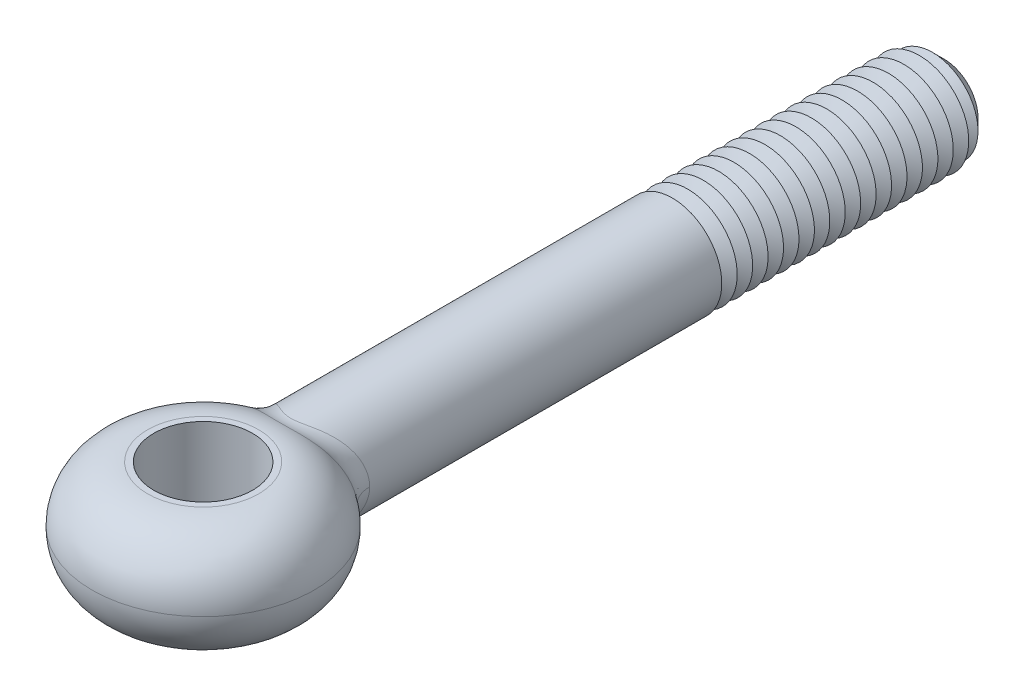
ISO-10303-21;
HEADER;
FILE_DESCRIPTION(('STEP AP214'),'2;1');
FILE_NAME('part.step','',(''),(''),'','','');
FILE_SCHEMA(('AUTOMOTIVE_DESIGN { 1 0 10303 214 1 1 1 1 }'));
ENDSEC;
DATA;
#1=APPLICATION_CONTEXT('core data for automotive mechanical design processes');
#2=APPLICATION_PROTOCOL_DEFINITION('international standard','automotive_design',2000,#1);
#3=PRODUCT_CONTEXT('',#1,'mechanical');
#4=PRODUCT('Part','Part','',(#3));
#5=PRODUCT_RELATED_PRODUCT_CATEGORY('part','',(#4));
#6=PRODUCT_DEFINITION_FORMATION('','',#4);
#7=PRODUCT_DEFINITION_CONTEXT('part definition',#1,'design');
#8=PRODUCT_DEFINITION('design','',#6,#7);
#9=PRODUCT_DEFINITION_SHAPE('','',#8);
#10=(LENGTH_UNIT() NAMED_UNIT(*) SI_UNIT(.MILLI.,.METRE.));
#11=(NAMED_UNIT(*) PLANE_ANGLE_UNIT() SI_UNIT($,.RADIAN.));
#12=(NAMED_UNIT(*) SI_UNIT($,.STERADIAN.) SOLID_ANGLE_UNIT());
#13=UNCERTAINTY_MEASURE_WITH_UNIT(LENGTH_MEASURE(1.E-05),#10,'distance_accuracy_value','');
#14=(GEOMETRIC_REPRESENTATION_CONTEXT(3) GLOBAL_UNCERTAINTY_ASSIGNED_CONTEXT((#13)) GLOBAL_UNIT_ASSIGNED_CONTEXT((#10,
#11,#12)) REPRESENTATION_CONTEXT('',''));
#15=CARTESIAN_POINT('',(0.,0.,0.));
#16=DIRECTION('',(0.,0.,1.));
#17=DIRECTION('',(1.,0.,0.));
#18=AXIS2_PLACEMENT_3D('',#15,#16,#17);
#19=CARTESIAN_POINT('',(0.,0.,-60.));
#20=DIRECTION('',(0.,0.,1.));
#21=DIRECTION('',(1.,0.,0.));
#22=AXIS2_PLACEMENT_3D('',#19,#20,#21);
#23=CYLINDRICAL_SURFACE('',#22,4.);
#24=CARTESIAN_POINT('',(0.,0.,-38.));
#25=DIRECTION('',(0.,0.,-1.));
#26=DIRECTION('',(-1.,0.,0.));
#27=AXIS2_PLACEMENT_3D('',#24,#25,#26);
#28=CIRCLE('',#27,4.);
#29=CARTESIAN_POINT('',(-4.,0.,-38.));
#30=VERTEX_POINT('',#29);
#31=EDGE_CURVE('E80',#30,#30,#28,.T.);
#32=ORIENTED_EDGE('',*,*,#31,.F.);
#33=EDGE_LOOP('',(#32));
#34=FACE_BOUND('',#33,.T.);
#35=CARTESIAN_POINT('',(4.20962840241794,-2.43928241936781,-7.13180336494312));
#36=CARTESIAN_POINT('',(3.41508318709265,-2.1022410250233,-7.85325099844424));
#37=CARTESIAN_POINT('',(3.24770536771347,-2.33503958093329,-8.94098956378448));
#38=CARTESIAN_POINT('',(4.28087481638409,-2.35167865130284,-7.15538303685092));
#39=CARTESIAN_POINT('',(3.46594050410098,-2.01878134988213,-7.88016438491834));
#40=CARTESIAN_POINT('',(3.3080123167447,-2.25117956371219,-8.98524624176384));
#41=CARTESIAN_POINT('',(4.34829202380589,-2.26129214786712,-7.17775809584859));
#42=CARTESIAN_POINT('',(3.51321978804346,-1.934229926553,-7.90531474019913));
#43=CARTESIAN_POINT('',(3.36528002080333,-2.16465573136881,-9.02717355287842));
#44=CARTESIAN_POINT('',(4.47506957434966,-2.07545821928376,-7.21991515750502));
#45=CARTESIAN_POINT('',(3.60104623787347,-1.76294616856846,-7.95222957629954));
#46=CARTESIAN_POINT('',(3.47326653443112,-1.98676342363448,-9.10606640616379));
#47=CARTESIAN_POINT('',(4.53442750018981,-1.98000928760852,-7.23969638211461));
#48=CARTESIAN_POINT('',(3.64154402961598,-1.67624067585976,-7.97396863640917));
#49=CARTESIAN_POINT('',(3.52398337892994,-1.89539350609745,-9.14303045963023));
#50=CARTESIAN_POINT('',(4.64467184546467,-1.78456033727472,-7.27647659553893));
#51=CARTESIAN_POINT('',(3.71589642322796,-1.50113175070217,-8.014023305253));
#52=CARTESIAN_POINT('',(3.61838416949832,-1.70829707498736,-9.21168368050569));
#53=CARTESIAN_POINT('',(4.69555410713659,-1.68455811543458,-7.293474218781));
#54=CARTESIAN_POINT('',(3.74970371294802,-1.41276539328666,-8.0323140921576));
#55=CARTESIAN_POINT('',(3.66206466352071,-1.6125684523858,-9.24337025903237));
#56=CARTESIAN_POINT('',(4.78841066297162,-1.4807377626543,-7.3245150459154));
#57=CARTESIAN_POINT('',(3.81076645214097,-1.23482800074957,-8.06545380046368));
#58=CARTESIAN_POINT('',(3.74191652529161,-1.41745837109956,-9.30118312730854));
#59=CARTESIAN_POINT('',(4.83038616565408,-1.37692015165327,-7.3385586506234));
#60=CARTESIAN_POINT('',(3.8379839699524,-1.1453037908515,-8.0802824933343));
#61=CARTESIAN_POINT('',(3.77808891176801,-1.31807741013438,-9.3273101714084));
#62=CARTESIAN_POINT('',(4.93998011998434,-1.06760765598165,-7.37523749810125));
#63=CARTESIAN_POINT('',(3.90855592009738,-0.880980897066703,-8.11882669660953));
#64=CARTESIAN_POINT('',(3.87264914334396,-1.02198339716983,-9.39550169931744));
#65=CARTESIAN_POINT('',(4.99497846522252,-0.857630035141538,-7.39366200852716));
#66=CARTESIAN_POINT('',(3.94292721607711,-0.705496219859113,-8.13773727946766));
#67=CARTESIAN_POINT('',(3.92027139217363,-0.8209791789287,-9.42968891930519));
#68=CARTESIAN_POINT('',(5.06845478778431,-0.431772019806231,-7.41827830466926));
#69=CARTESIAN_POINT('',(3.98870275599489,-0.353118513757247,-8.16296207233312));
#70=CARTESIAN_POINT('',(3.98393665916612,-0.413320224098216,-9.47534719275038));
#71=CARTESIAN_POINT('',(5.08696110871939,-0.215896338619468,-7.42447958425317));
#72=CARTESIAN_POINT('',(4.00000180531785,-0.176691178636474,-8.16921842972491));
#73=CARTESIAN_POINT('',(4.00000418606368,-0.206669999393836,-9.48683587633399));
#74=CARTESIAN_POINT('',(5.08695185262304,0.2197622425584,-7.42447635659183));
#75=CARTESIAN_POINT('',(3.99999816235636,0.179854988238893,-8.16921612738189));
#76=CARTESIAN_POINT('',(3.99999573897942,0.210370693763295,-9.48683003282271));
#77=CARTESIAN_POINT('',(5.06776741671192,0.439545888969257,-7.41804771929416));
#78=CARTESIAN_POINT('',(3.98828744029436,0.359474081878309,-8.16273153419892));
#79=CARTESIAN_POINT('',(3.98333904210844,0.420761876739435,-9.47492027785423));
#80=CARTESIAN_POINT('',(4.99168987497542,0.872694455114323,-7.39256061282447));
#81=CARTESIAN_POINT('',(3.94086979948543,0.718015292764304,-8.13660527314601));
#82=CARTESIAN_POINT('',(3.91742407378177,0.835399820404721,-9.42764524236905));
#83=CARTESIAN_POINT('',(4.93478135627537,1.08605671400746,-7.37349698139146));
#84=CARTESIAN_POINT('',(3.90528498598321,0.896448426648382,-8.11703072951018));
#85=CARTESIAN_POINT('',(3.86815247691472,1.03964403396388,-9.39227037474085));
#86=CARTESIAN_POINT('',(4.78531683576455,1.49992996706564,-7.32347555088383));
#87=CARTESIAN_POINT('',(3.80902553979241,1.25022198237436,-8.06447660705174));
#88=CARTESIAN_POINT('',(3.73921411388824,1.43583039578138,-9.29926343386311));
#89=CARTESIAN_POINT('',(4.69282180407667,1.70046226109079,-7.29253809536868));
#90=CARTESIAN_POINT('',(3.74864333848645,1.42515573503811,-8.03165463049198));
#91=CARTESIAN_POINT('',(3.65959933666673,1.62779293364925,-9.24166942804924));
#92=CARTESIAN_POINT('',(4.47502076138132,2.08399669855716,-7.2198795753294));
#93=CARTESIAN_POINT('',(3.60161000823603,1.76909189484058,-7.95246604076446));
#94=CARTESIAN_POINT('',(3.47312999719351,1.99493701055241,-9.10603484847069));
#95=CARTESIAN_POINT('',(4.34971613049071,2.26699957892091,-7.17815896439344));
#96=CARTESIAN_POINT('',(3.51529520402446,1.93780912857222,-7.90627607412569));
#97=CARTESIAN_POINT('',(3.36627658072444,2.17011925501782,-9.02799513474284));
#98=CARTESIAN_POINT('',(4.06503409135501,2.61710755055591,-7.08395651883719));
#99=CARTESIAN_POINT('',(3.31258804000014,2.2704191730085,-7.7990178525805));
#100=CARTESIAN_POINT('',(3.12531975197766,2.50526534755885,-8.85118504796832));
#101=CARTESIAN_POINT('',(3.90469024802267,2.78351182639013,-7.03117167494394));
#102=CARTESIAN_POINT('',(3.19569010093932,2.43389360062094,-7.73770595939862));
#103=CARTESIAN_POINT('',(2.99045029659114,2.66455832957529,-8.75182853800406));
#104=CARTESIAN_POINT('',(3.55572279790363,3.09056742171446,-6.91783262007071));
#105=CARTESIAN_POINT('',(2.93333047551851,2.74510282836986,-7.60227773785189));
#106=CARTESIAN_POINT('',(2.70000717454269,2.95849189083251,-8.5376096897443));
#107=CARTESIAN_POINT('',(3.36708914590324,3.23120955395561,-6.85727565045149));
#108=CARTESIAN_POINT('',(2.78824007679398,2.89288136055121,-7.52833413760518));
#109=CARTESIAN_POINT('',(2.54442615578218,3.09312367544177,-8.42274184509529));
#110=CARTESIAN_POINT('',(3.05590482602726,3.42698066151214,-6.7601891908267));
#111=CARTESIAN_POINT('',(2.54246419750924,3.10521527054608,-7.40650692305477));
#112=CARTESIAN_POINT('',(2.29139242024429,3.28052849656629,-8.23777021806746));
#113=CARTESIAN_POINT('',(2.94239191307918,3.49188009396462,-6.72527979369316));
#114=CARTESIAN_POINT('',(2.45203508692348,3.17679613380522,-7.3622733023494));
#115=CARTESIAN_POINT('',(2.19974288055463,3.34265444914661,-8.1711096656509));
#116=CARTESIAN_POINT('',(2.70774871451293,3.61334721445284,-6.65476356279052));
#117=CARTESIAN_POINT('',(2.2631888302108,3.31294369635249,-7.27185687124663));
#118=CARTESIAN_POINT('',(2.01195985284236,3.45893066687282,-8.03614064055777));
#119=CARTESIAN_POINT('',(2.58662025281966,3.66991688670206,-6.61915689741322));
#120=CARTESIAN_POINT('',(2.16480399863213,3.37756025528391,-7.22567879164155));
#121=CARTESIAN_POINT('',(1.91582743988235,3.51308283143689,-7.96783256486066));
#122=CARTESIAN_POINT('',(2.33643912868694,3.7746567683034,-6.5481070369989));
#123=CARTESIAN_POINT('',(1.95995542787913,3.49905860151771,-7.13254784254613));
#124=CARTESIAN_POINT('',(1.71927955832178,3.61334665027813,-7.83121951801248));
#125=CARTESIAN_POINT('',(2.20737584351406,3.82281537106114,-6.51266413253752));
#126=CARTESIAN_POINT('',(1.85349180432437,3.55598889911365,-7.08558378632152));
#127=CARTESIAN_POINT('',(1.61885840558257,3.65944719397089,-7.76291467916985));
#128=CARTESIAN_POINT('',(1.94104355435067,3.91049331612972,-6.44329335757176));
#129=CARTESIAN_POINT('',(1.6325295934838,3.66114192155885,-6.99281685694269));
#130=CARTESIAN_POINT('',(1.41399106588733,3.74337821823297,-7.62894442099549));
#131=CARTESIAN_POINT('',(1.80377767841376,3.9500159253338,-6.40936491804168));
#132=CARTESIAN_POINT('',(1.51802234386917,3.70943392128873,-6.94698677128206));
#133=CARTESIAN_POINT('',(1.3095464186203,3.78121182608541,-7.56327801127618));
#134=CARTESIAN_POINT('',(1.57227788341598,4.0073375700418,-6.35676863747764));
#135=CARTESIAN_POINT('',(1.32409359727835,3.78043323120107,-6.87537018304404));
#136=CARTESIAN_POINT('',(1.13554714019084,3.83608382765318,-7.46130151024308));
#137=CARTESIAN_POINT('',(1.48068953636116,4.02779217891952,-6.33706161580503));
#138=CARTESIAN_POINT('',(1.24725687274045,3.80602263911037,-6.84840856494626));
#139=CARTESIAN_POINT('',(1.0672193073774,3.85566430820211,-7.42304591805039));
#140=CARTESIAN_POINT('',(1.29376653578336,4.06503946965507,-6.29972707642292));
#141=CARTESIAN_POINT('',(1.09023122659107,3.85298164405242,-6.79713154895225));
#142=CARTESIAN_POINT('',(0.928835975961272,3.89131983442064,-7.35050186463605));
#143=CARTESIAN_POINT('',(1.19843101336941,4.08183129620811,-6.28210004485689));
#144=CARTESIAN_POINT('',(1.01002281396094,3.87436823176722,-6.77280179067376));
#145=CARTESIAN_POINT('',(0.858780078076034,3.90739406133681,-7.31621433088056));
#146=CARTESIAN_POINT('',(1.00443416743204,4.11153418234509,-6.24984169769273));
#147=CARTESIAN_POINT('',(0.846704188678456,3.91244466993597,-6.72814466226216));
#148=CARTESIAN_POINT('',(0.717251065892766,3.93582759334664,-7.25341859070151));
#149=CARTESIAN_POINT('',(0.905787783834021,4.12446059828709,-6.23519860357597));
#150=CARTESIAN_POINT('',(0.763580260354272,3.92916988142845,-6.70778483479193));
#151=CARTESIAN_POINT('',(0.645784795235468,3.94820159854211,-7.22488766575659));
#152=CARTESIAN_POINT('',(0.705195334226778,4.14632005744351,-6.20979408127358));
#153=CARTESIAN_POINT('',(0.594535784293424,3.95758629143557,-6.67239577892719));
#154=CARTESIAN_POINT('',(0.5013462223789,3.96912689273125,-7.17536275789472));
#155=CARTESIAN_POINT('',(0.603251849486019,4.15525614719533,-6.19902969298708));
#156=CARTESIAN_POINT('',(0.508579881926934,3.96929598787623,-6.65734565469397));
#157=CARTESIAN_POINT('',(0.428375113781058,3.97768109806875,-7.1543630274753));
#158=CARTESIAN_POINT('',(0.412029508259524,4.16793662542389,-6.18352731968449));
#159=CARTESIAN_POINT('',(0.347370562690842,3.98595413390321,-6.63565356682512));
#160=CARTESIAN_POINT('',(0.292075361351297,3.98981967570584,-7.12411158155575));
#161=CARTESIAN_POINT('',(0.32308798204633,4.17225051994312,-6.17813670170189));
#162=CARTESIAN_POINT('',(0.272375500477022,3.99164885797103,-6.62809397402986));
#163=CARTESIAN_POINT('',(0.228903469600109,3.99394921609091,-7.11358793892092));
#164=CARTESIAN_POINT('',(0.144284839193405,4.17773453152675,-6.17125850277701));
#165=CARTESIAN_POINT('',(0.121644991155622,3.99889046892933,-6.61844960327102));
#166=CARTESIAN_POINT('',(0.102130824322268,3.99919886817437,-7.10015930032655));
#167=CARTESIAN_POINT('',(0.0544233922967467,4.17890521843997,-6.16977021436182));
#168=CARTESIAN_POINT('',(0.0458757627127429,4.00044140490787,-6.61635946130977));
#169=CARTESIAN_POINT('',(0.0385301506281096,4.00031952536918,-7.09725292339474));
#170=CARTESIAN_POINT('',(-0.125189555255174,4.17807377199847,-6.17082052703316));
#171=CARTESIAN_POINT('',(-0.105535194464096,3.9993418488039,-6.61783304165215));
#172=CARTESIAN_POINT('',(-0.0886280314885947,3.99952361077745,-7.09930377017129));
#173=CARTESIAN_POINT('',(-0.214940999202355,4.17607039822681,-6.17336070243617));
#174=CARTESIAN_POINT('',(-0.181212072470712,3.99668920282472,-6.62139966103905));
#175=CARTESIAN_POINT('',(-0.152185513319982,3.9976058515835,-7.1042640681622));
#176=CARTESIAN_POINT('',(-0.393267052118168,4.16893881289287,-6.18226051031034));
#177=CARTESIAN_POINT('',(-0.331541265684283,3.98728173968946,-6.633873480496));
#178=CARTESIAN_POINT('',(-0.278751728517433,3.99077903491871,-7.12163796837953));
#179=CARTESIAN_POINT('',(-0.481841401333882,4.16380992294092,-6.18862097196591));
#180=CARTESIAN_POINT('',(-0.406226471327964,3.98052180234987,-6.64278739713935));
#181=CARTESIAN_POINT('',(-0.341760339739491,3.98586932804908,-7.13405318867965));
#182=CARTESIAN_POINT('',(-0.688095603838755,4.14817563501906,-6.20755254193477));
#183=CARTESIAN_POINT('',(-0.580119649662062,3.96002144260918,-6.66925886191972));
#184=CARTESIAN_POINT('',(-0.48906356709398,3.97090317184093,-7.17098958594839));
#185=CARTESIAN_POINT('',(-0.804946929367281,4.13640802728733,-6.22152677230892));
#186=CARTESIAN_POINT('',(-0.678644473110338,3.9446436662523,-6.68877522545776));
#187=CARTESIAN_POINT('',(-0.57297516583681,3.95963845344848,-7.19824359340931));
#188=CARTESIAN_POINT('',(-1.03394062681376,4.1076481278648,-6.25415363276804));
#189=CARTESIAN_POINT('',(-0.871568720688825,3.90744263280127,-6.73412611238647));
#190=CARTESIAN_POINT('',(-0.73864371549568,3.93210760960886,-7.26181631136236));
#191=CARTESIAN_POINT('',(-1.14608021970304,4.09065280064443,-6.27280897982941));
#192=CARTESIAN_POINT('',(-0.966017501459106,3.88559131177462,-6.75999090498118));
#193=CARTESIAN_POINT('',(-0.820399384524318,3.9158385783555,-7.29814028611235));
#194=CARTESIAN_POINT('',(-1.36592763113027,4.05161532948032,-6.31347216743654));
#195=CARTESIAN_POINT('',(-1.15091612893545,3.83597962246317,-6.81605607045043));
#196=CARTESIAN_POINT('',(-0.982033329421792,3.87846937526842,-7.37722308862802));
#197=CARTESIAN_POINT('',(-1.47361079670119,4.02954864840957,-6.33549612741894));
#198=CARTESIAN_POINT('',(-1.24137763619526,3.80816351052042,-6.84630178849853));
#199=CARTESIAN_POINT('',(-1.06190032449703,3.85734571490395,-7.42001284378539));
#200=CARTESIAN_POINT('',(-1.68409994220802,3.98060721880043,-6.38167314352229));
#201=CARTESIAN_POINT('',(-1.41779320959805,3.74723624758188,-6.90932190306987));
#202=CARTESIAN_POINT('',(-1.21937267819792,3.81049579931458,-7.50960647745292));
#203=CARTESIAN_POINT('',(-1.7869061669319,3.95373271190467,-6.40582609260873));
#204=CARTESIAN_POINT('',(-1.50376847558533,3.71409743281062,-6.94211616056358));
#205=CARTESIAN_POINT('',(-1.29697815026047,3.78476977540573,-7.55641015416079));
#206=CARTESIAN_POINT('',(-2.03557249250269,3.88144037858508,-6.46712101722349));
#207=CARTESIAN_POINT('',(-1.71119137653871,3.62603584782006,-7.02483194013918));
#208=CARTESIAN_POINT('',(-1.48626510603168,3.71556685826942,-7.67500708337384));
#209=CARTESIAN_POINT('',(-2.17875790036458,3.8332690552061,-6.50499609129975));
#210=CARTESIAN_POINT('',(-1.82993325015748,3.568260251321,-7.07544885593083));
#211=CARTESIAN_POINT('',(-1.59667404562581,3.66945413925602,-7.74813538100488));
#212=CARTESIAN_POINT('',(-2.45590601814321,3.72693983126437,-6.58149722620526));
#213=CARTESIAN_POINT('',(-2.05811594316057,3.44332588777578,-7.17652007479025));
#214=CARTESIAN_POINT('',(-1.81273207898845,3.56766889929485,-7.8954804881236));
#215=CARTESIAN_POINT('',(-2.58986577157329,3.66877875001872,-6.62012352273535));
#216=CARTESIAN_POINT('',(-2.16754889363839,3.37608608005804,-7.22699422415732));
#217=CARTESIAN_POINT('',(-1.9183796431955,3.51199333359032,-7.96969763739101));
#218=CARTESIAN_POINT('',(-2.84860171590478,3.5427552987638,-6.69676099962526));
#219=CARTESIAN_POINT('',(-2.37693766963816,3.23337235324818,-7.32592299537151));
#220=CARTESIAN_POINT('',(-2.12436385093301,3.39135549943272,-8.11658331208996));
#221=CARTESIAN_POINT('',(-2.97339489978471,3.47491160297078,-6.73477321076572));
#222=CARTESIAN_POINT('',(-2.4768805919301,3.15784823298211,-7.37438139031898));
#223=CARTESIAN_POINT('',(-2.22471021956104,3.32641110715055,-8.18925451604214));
#224=CARTESIAN_POINT('',(-3.21406230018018,3.32961759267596,-6.80935300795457));
#225=CARTESIAN_POINT('',(-2.6674564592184,2.99941031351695,-7.4682507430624));
#226=CARTESIAN_POINT('',(-2.41977314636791,3.18732624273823,-8.33148796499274));
#227=CARTESIAN_POINT('',(-3.32993337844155,3.2521639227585,-6.84592008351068));
#228=CARTESIAN_POINT('',(-2.75803338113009,2.91644504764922,-7.51364407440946));
#229=CARTESIAN_POINT('',(-2.5144877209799,3.11318255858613,-8.40104911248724));
#230=CARTESIAN_POINT('',(-3.55210969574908,3.08816037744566,-6.91681788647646));
#231=CARTESIAN_POINT('',(-2.92947959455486,2.74434343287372,-7.60050775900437));
#232=CARTESIAN_POINT('',(-2.69730128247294,2.95618771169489,-8.53560605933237));
#233=CARTESIAN_POINT('',(-3.65843710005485,3.00163264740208,-6.95115374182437));
#234=CARTESIAN_POINT('',(-3.01030527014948,2.65519145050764,-7.64195973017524));
#235=CARTESIAN_POINT('',(-2.78541551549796,2.87335774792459,-8.6006123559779));
#236=CARTESIAN_POINT('',(-3.86134707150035,2.81971508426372,-7.01714488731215));
#237=CARTESIAN_POINT('',(-3.16239702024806,2.47150088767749,-7.72058753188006));
#238=CARTESIAN_POINT('',(-2.95448336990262,2.69921443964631,-8.725285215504));
#239=CARTESIAN_POINT('',(-3.95792606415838,2.72432202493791,-7.04879919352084));
#240=CARTESIAN_POINT('',(-3.23358189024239,2.37695238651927,-7.75772562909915));
#241=CARTESIAN_POINT('',(-3.03543436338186,2.6078980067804,-8.78494981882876));
#242=CARTESIAN_POINT('',(-4.14062182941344,2.52529349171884,-7.10894613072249));
#243=CARTESIAN_POINT('',(-3.36627848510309,2.18351039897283,-7.82739060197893));
#244=CARTESIAN_POINT('',(-3.18924486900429,2.41737496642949,-8.89810456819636));
#245=CARTESIAN_POINT('',(-4.22674123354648,2.42166010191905,-7.13743955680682));
#246=CARTESIAN_POINT('',(-3.42771044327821,2.08463231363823,-7.85987815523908));
#247=CARTESIAN_POINT('',(-3.26210641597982,2.31817035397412,-8.95159626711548));
#248=CARTESIAN_POINT('',(-4.38787338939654,2.20680171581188,-7.19089612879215));
#249=CARTESIAN_POINT('',(-3.54098239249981,1.88340090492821,-7.92009157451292));
#250=CARTESIAN_POINT('',(-3.39891556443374,2.11249395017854,-9.05178694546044));
#251=CARTESIAN_POINT('',(-4.46288140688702,2.09557351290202,-7.21585776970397));
#252=CARTESIAN_POINT('',(-3.59273623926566,1.78108328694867,-7.94777357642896));
#253=CARTESIAN_POINT('',(-3.46285936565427,2.00601908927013,-9.0984830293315));
#254=CARTESIAN_POINT('',(-4.59457320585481,1.87716338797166,-7.25975188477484));
#255=CARTESIAN_POINT('',(-3.68233447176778,1.58359654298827,-7.99590902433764));
#256=CARTESIAN_POINT('',(-3.57543701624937,1.7969427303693,-9.18048322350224));
#257=CARTESIAN_POINT('',(-4.65231387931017,1.77057286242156,-7.27902964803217));
#258=CARTESIAN_POINT('',(-3.72098386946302,1.4886580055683,-8.01677413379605));
#259=CARTESIAN_POINT('',(-3.62494279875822,1.69490735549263,-9.21644383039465));
#260=CARTESIAN_POINT('',(-4.75753290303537,1.55269637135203,-7.31418809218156));
#261=CARTESIAN_POINT('',(-3.79061799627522,1.29722505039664,-8.05449646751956));
#262=CARTESIAN_POINT('',(-3.71533333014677,1.48634182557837,-9.28196073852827));
#263=CARTESIAN_POINT('',(-4.80501232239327,1.4414108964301,-7.33006912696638));
#264=CARTESIAN_POINT('',(-3.82155281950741,1.20078670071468,-8.07132717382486));
#265=CARTESIAN_POINT('',(-3.75621897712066,1.37981214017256,-9.31151770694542));
#266=CARTESIAN_POINT('',(-4.88918515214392,1.21522310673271,-7.35823582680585));
#267=CARTESIAN_POINT('',(-3.87588351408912,1.00699635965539,-8.10097036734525));
#268=CARTESIAN_POINT('',(-3.82880765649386,1.16329049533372,-9.36389868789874));
#269=CARTESIAN_POINT('',(-4.92589907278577,1.10032813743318,-7.3705283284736));
#270=CARTESIAN_POINT('',(-3.89925185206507,0.909712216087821,-8.11376793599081));
#271=CARTESIAN_POINT('',(-3.86052814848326,1.05330556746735,-9.38673550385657));
#272=CARTESIAN_POINT('',(-4.98828435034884,0.867715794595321,-7.39142041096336));
#273=CARTESIAN_POINT('',(-3.93869332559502,0.714454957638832,-8.13541291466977));
#274=CARTESIAN_POINT('',(-3.91448130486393,0.830633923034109,-9.42552718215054));
#275=CARTESIAN_POINT('',(-5.01396103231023,0.749999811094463,-7.4000217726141));
#276=CARTESIAN_POINT('',(-3.95473808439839,0.616556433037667,-8.14424484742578));
#277=CARTESIAN_POINT('',(-3.93671854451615,0.717948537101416,-9.4414853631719));
#278=CARTESIAN_POINT('',(-5.05160356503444,0.527069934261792,-7.41263256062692));
#279=CARTESIAN_POINT('',(-3.97817394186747,0.432202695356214,-8.15716098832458));
#280=CARTESIAN_POINT('',(-3.96933623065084,0.504545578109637,-9.46487511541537));
#281=CARTESIAN_POINT('',(-5.06485252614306,0.422066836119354,-7.41707168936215));
#282=CARTESIAN_POINT('',(-3.98636384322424,0.345839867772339,-8.16168301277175));
#283=CARTESIAN_POINT('',(-3.98082580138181,0.404029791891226,-9.47310478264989));
#284=CARTESIAN_POINT('',(-5.08253053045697,0.211392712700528,-7.42299491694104));
#285=CARTESIAN_POINT('',(-3.99727804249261,0.172971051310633,-8.16771217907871));
#286=CARTESIAN_POINT('',(-3.99615939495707,0.202358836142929,-9.48408450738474));
#287=CARTESIAN_POINT('',(-5.0869624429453,0.105721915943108,-7.42447997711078));
#288=CARTESIAN_POINT('',(-3.99999698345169,0.0865213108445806,-8.16921636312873));
#289=CARTESIAN_POINT('',(-4.00000590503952,0.101203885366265,-9.48683634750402));
#290=CARTESIAN_POINT('',(-5.08694423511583,-0.219375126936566,-7.42447385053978));
#291=CARTESIAN_POINT('',(-4.00000625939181,-0.179533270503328,-8.16921920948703));
#292=CARTESIAN_POINT('',(-3.99998774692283,-0.210000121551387,-9.48682599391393));
#293=CARTESIAN_POINT('',(-5.06782392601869,-0.438970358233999,-7.41806690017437));
#294=CARTESIAN_POINT('',(-3.98832493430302,-0.358996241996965,-8.16275208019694));
#295=CARTESIAN_POINT('',(-3.98338811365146,-0.420210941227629,-9.47495588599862));
#296=CARTESIAN_POINT('',(-4.99181098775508,-0.872258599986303,-7.39260093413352));
#297=CARTESIAN_POINT('',(-3.94094286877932,-0.717656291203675,-8.13664564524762));
#298=CARTESIAN_POINT('',(-3.91752889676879,-0.83498259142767,-9.42771999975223));
#299=CARTESIAN_POINT('',(-4.93481503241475,-1.08593379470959,-7.37350730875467));
#300=CARTESIAN_POINT('',(-3.9053086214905,-0.89636142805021,-8.11704297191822));
#301=CARTESIAN_POINT('',(-3.86817997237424,-1.03952636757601,-9.3922899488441));
#302=CARTESIAN_POINT('',(-4.82260503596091,-1.39669226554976,-7.33595529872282));
#303=CARTESIAN_POINT('',(-3.8329428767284,-1.16232084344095,-8.07753492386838));
#304=CARTESIAN_POINT('',(-3.77138225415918,-1.3370045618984,-9.32246736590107));
#305=CARTESIAN_POINT('',(-4.78077456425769,-1.4986077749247,-7.32196123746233));
#306=CARTESIAN_POINT('',(-3.80577950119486,-1.25032878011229,-8.0627417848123));
#307=CARTESIAN_POINT('',(-3.73534257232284,-1.43456470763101,-9.29642949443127));
#308=CARTESIAN_POINT('',(-4.6885140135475,-1.6987113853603,-7.29112215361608));
#309=CARTESIAN_POINT('',(-3.74503190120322,-1.42524573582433,-8.02978510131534));
#310=CARTESIAN_POINT('',(-3.65601915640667,-1.62611688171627,-9.23898630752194));
#311=CARTESIAN_POINT('',(-4.63808284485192,-1.79689901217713,-7.27427676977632));
#312=CARTESIAN_POINT('',(-3.7114841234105,-1.51211059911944,-8.01164097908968));
#313=CARTESIAN_POINT('',(-3.6127345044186,-1.72010845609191,-9.20758031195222));
#314=CARTESIAN_POINT('',(-4.52912947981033,-1.98866953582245,-7.23793066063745));
#315=CARTESIAN_POINT('',(-3.63793253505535,-1.68409419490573,-7.97202907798));
#316=CARTESIAN_POINT('',(-3.51945525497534,-1.90368365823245,-9.13973150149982));
#317=CARTESIAN_POINT('',(-4.47062629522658,-2.08226257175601,-7.21843617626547));
#318=CARTESIAN_POINT('',(-3.59798595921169,-1.76918038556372,-7.95059120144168));
#319=CARTESIAN_POINT('',(-3.46947643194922,-1.99327699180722,-9.10330052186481));
#320=CARTESIAN_POINT('',(-4.34585406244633,-2.2645576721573,-7.17694883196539));
#321=CARTESIAN_POINT('',(-3.51150587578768,-1.93729298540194,-7.90440294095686));
#322=CARTESIAN_POINT('',(-3.36320902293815,-2.16778170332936,-9.02565711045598));
#323=CARTESIAN_POINT('',(-4.27958724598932,-2.3532611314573,-7.15495669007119));
#324=CARTESIAN_POINT('',(-3.46501911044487,-2.02029414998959,-7.87967661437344));
#325=CARTESIAN_POINT('',(-3.30692225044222,-2.2526944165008,-8.98444605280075));
#326=CARTESIAN_POINT('',(-4.20962840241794,-2.43928241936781,-7.13180336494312));
#327=CARTESIAN_POINT('',(-3.41508318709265,-2.1022410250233,-7.85325099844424));
#328=CARTESIAN_POINT('',(-3.24770536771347,-2.33503958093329,-8.94098956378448));
#329=(BOUNDED_SURFACE() B_SPLINE_SURFACE(3,2,((#35,#36,#37),(#38,#39,#40),(#41,#42,#43),(#44,
#45,#46),(#47,#48,#49),(#50,#51,#52),(#53,#54,#55),(#56,#57,#58),(#59,#60,#61),(#62,#63,#64),
(#65,#66,#67),(#68,#69,#70),(#71,#72,#73),(#74,#75,#76),(#77,#78,#79),(#80,#81,#82),(#83,#84,
#85),(#86,#87,#88),(#89,#90,#91),(#92,#93,#94),(#95,#96,#97),(#98,#99,#100),(#101,#102,#103),
(#104,#105,#106),(#107,#108,#109),(#110,#111,#112),(#113,#114,#115),(#116,#117,#118),(#119,#120,
#121),(#122,#123,#124),(#125,#126,#127),(#128,#129,#130),(#131,#132,#133),(#134,#135,#136),
(#137,#138,#139),(#140,#141,#142),(#143,#144,#145),(#146,#147,#148),(#149,#150,#151),(#152,#153,
#154),(#155,#156,#157),(#158,#159,#160),(#161,#162,#163),(#164,#165,#166),(#167,#168,#169),
(#170,#171,#172),(#173,#174,#175),(#176,#177,#178),(#179,#180,#181),(#182,#183,#184),(#185,#186,
#187),(#188,#189,#190),(#191,#192,#193),(#194,#195,#196),(#197,#198,#199),(#200,#201,#202),
(#203,#204,#205),(#206,#207,#208),(#209,#210,#211),(#212,#213,#214),(#215,#216,#217),(#218,#219,
#220),(#221,#222,#223),(#224,#225,#226),(#227,#228,#229),(#230,#231,#232),(#233,#234,#235),
(#236,#237,#238),(#239,#240,#241),(#242,#243,#244),(#245,#246,#247),(#248,#249,#250),(#251,#252,
#253),(#254,#255,#256),(#257,#258,#259),(#260,#261,#262),(#263,#264,#265),(#266,#267,#268),
(#269,#270,#271),(#272,#273,#274),(#275,#276,#277),(#278,#279,#280),(#281,#282,#283),(#284,#285,
#286),(#287,#288,#289),(#290,#291,#292),(#293,#294,#295),(#296,#297,#298),(#299,#300,#301),
(#302,#303,#304),(#305,#306,#307),(#308,#309,#310),(#311,#312,#313),(#314,#315,#316),(#317,#318,
#319),(#320,#321,#322),(#323,#324,#325),(#326,#327,#328)),.UNSPECIFIED.,.F.,.F.,
.F.) B_SPLINE_SURFACE_WITH_KNOTS((4,2,2,2,2,2,2,2,2,2,2,2,2,2,2,2,2,2,2,2,2,2,2,2,2,2,2,2,2,2,2,
2,2,2,2,2,2,2,2,2,2,2,2,2,2,2,2,2,4),(3,3),(0.,0.520645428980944,1.04144667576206,
1.56250265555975,2.08348789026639,3.09060934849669,4.09694825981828,5.12130697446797,
6.14608446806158,7.16911398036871,8.19210046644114,9.2479961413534,10.3042676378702,
10.8793995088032,11.4543941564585,12.0301760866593,12.6057398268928,12.9705703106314,
13.3354858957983,13.6989318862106,14.0620999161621,14.3719634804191,14.6817708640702,
14.9916993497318,15.301695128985,15.7217247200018,16.1419986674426,16.5643505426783,
16.9866811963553,17.6090733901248,18.2316641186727,18.8530699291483,19.4746933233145,
20.0948334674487,20.7152001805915,21.335410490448,21.9558842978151,22.5184424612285,
23.0809419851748,23.6423627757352,24.2035123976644,24.6967605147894,25.1898480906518,
26.2130148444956,27.2389843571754,27.7514948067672,28.2640702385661,28.7754583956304,
29.2866999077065),(0.,1.),
.UNSPECIFIED.) GEOMETRIC_REPRESENTATION_ITEM() RATIONAL_B_SPLINE_SURFACE(((1.,0.911936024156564,
1.),(1.,0.909850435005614,1.),(1.,0.907844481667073,1.),(1.,0.904024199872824,1.),(1.,
0.902209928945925,1.),(1.,0.898805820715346,1.),(1.,0.897216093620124,1.),(1.,0.894291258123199,
1.),(1.,0.892956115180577,1.),(1.,0.889449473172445,1.),(1.,0.887660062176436,1.),(1.,
0.885261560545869,1.),(1.,0.884651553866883,1.),(1.,0.884651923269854,1.),(1.,0.885284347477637,
1.),(1.,0.887767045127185,1.),(1.,0.889617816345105,1.),(1.,0.894396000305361,1.),(1.,
0.897321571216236,1.),(1.,0.904041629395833,1.),(1.,0.907836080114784,1.),(1.,0.91616786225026,
1.),(1.,0.920725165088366,1.),(1.,0.930174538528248,1.),(1.,0.935066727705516,1.),(1.,
0.942600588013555,1.),(1.,0.945252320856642,1.),(1.,0.950486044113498,1.),(1.,0.953068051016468,
1.),(1.,0.958095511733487,1.),(1.,0.960540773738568,1.),(1.,0.965207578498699,1.),(1.,
0.967429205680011,1.),(1.,0.970790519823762,1.),(1.,0.972028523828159,1.),(1.,0.974339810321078,
1.),(1.,0.975413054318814,1.),(1.,0.97735209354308,1.),(1.,0.978218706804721,1.),(1.,
0.979707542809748,1.),(1.,0.980329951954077,1.),(1.,0.981221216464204,1.),(1.,0.981528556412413,
1.),(1.,0.981920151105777,1.),(1.,0.982004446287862,1.),(1.,0.981944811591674,1.),(1.,
0.981800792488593,1.),(1.,0.981293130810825,1.),(1.,0.98092944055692,1.),(1.,0.979837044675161,
1.),(1.,0.979024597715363,1.),(1.,0.977095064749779,1.),(1.,0.975977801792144,1.),(1.,
0.973495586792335,1.),(1.,0.972129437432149,1.),(1.,0.969207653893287,1.),(1.,0.967652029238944,
1.),(1.,0.963624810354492,1.),(1.,0.961068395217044,1.),(1.,0.955756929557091,1.),(1.,
0.95300181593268,1.),(1.,0.947392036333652,1.),(1.,0.94453756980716,1.),(1.,0.938804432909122,
1.),(1.,0.935925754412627,1.),(1.,0.930226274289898,1.),(1.,0.927405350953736,1.),(1.,
0.921882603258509,1.),(1.,0.919180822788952,1.),(1.,0.913963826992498,1.),(1.,0.9114485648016,
1.),(1.,0.906664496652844,1.),(1.,0.904395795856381,1.),(1.,0.900360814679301,1.),(1.,
0.898567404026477,1.),(1.,0.89526897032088,1.),(1.,0.893763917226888,1.),(1.,0.89107726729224,
1.),(1.,0.889895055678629,1.),(1.,0.88787678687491,1.),(1.,0.887040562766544,1.),(1.,
0.885811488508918,1.),(1.,0.88537723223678,1.),(1.,0.884797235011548,1.),(1.,0.884651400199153,
1.),(1.,0.884652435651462,1.),(1.,0.885282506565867,1.),(1.,0.887763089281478,1.),(1.,
0.889616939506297,1.),(1.,0.893203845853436,1.),(1.,0.894533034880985,1.),(1.,0.897436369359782,
1.),(1.,0.899010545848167,1.),(1.,0.902372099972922,1.),(1.,0.904158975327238,1.),(1.,
0.907917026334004,1.),(1.,0.909888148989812,1.),(1.,0.911936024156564,1.))) REPRESENTATION_ITEM('') SURFACE());
#330=CARTESIAN_POINT('',(-3.24770536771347,-2.33503958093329,-8.94098956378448));
#331=CARTESIAN_POINT('',(-3.30692225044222,-2.2526944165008,-8.98444605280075));
#332=CARTESIAN_POINT('',(-3.36320902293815,-2.16778170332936,-9.02565711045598));
#333=CARTESIAN_POINT('',(-3.46947643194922,-1.99327699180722,-9.10330052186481));
#334=CARTESIAN_POINT('',(-3.51945525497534,-1.90368365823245,-9.13973150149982));
#335=CARTESIAN_POINT('',(-3.6127345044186,-1.72010845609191,-9.20758031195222));
#336=CARTESIAN_POINT('',(-3.65601915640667,-1.62611688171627,-9.23898630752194));
#337=CARTESIAN_POINT('',(-3.73534257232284,-1.43456470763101,-9.29642949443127));
#338=CARTESIAN_POINT('',(-3.77138225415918,-1.3370045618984,-9.32246736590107));
#339=CARTESIAN_POINT('',(-3.86817997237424,-1.03952636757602,-9.3922899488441));
#340=CARTESIAN_POINT('',(-3.91752889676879,-0.83498259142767,-9.42771999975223));
#341=CARTESIAN_POINT('',(-3.98338811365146,-0.420210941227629,-9.47495588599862));
#342=CARTESIAN_POINT('',(-3.99998774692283,-0.210000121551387,-9.48682599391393));
#343=CARTESIAN_POINT('',(-4.00000590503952,0.101203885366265,-9.48683634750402));
#344=CARTESIAN_POINT('',(-3.99615939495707,0.202358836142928,-9.48408450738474));
#345=CARTESIAN_POINT('',(-3.98082580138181,0.404029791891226,-9.47310478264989));
#346=CARTESIAN_POINT('',(-3.96933623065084,0.504545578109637,-9.46487511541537));
#347=CARTESIAN_POINT('',(-3.93671854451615,0.717948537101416,-9.4414853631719));
#348=CARTESIAN_POINT('',(-3.91448130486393,0.830633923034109,-9.42552718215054));
#349=CARTESIAN_POINT('',(-3.86052814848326,1.05330556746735,-9.38673550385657));
#350=CARTESIAN_POINT('',(-3.82880765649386,1.16329049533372,-9.36389868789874));
#351=CARTESIAN_POINT('',(-3.75621897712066,1.37981214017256,-9.31151770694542));
#352=CARTESIAN_POINT('',(-3.71533333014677,1.48634182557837,-9.28196073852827));
#353=CARTESIAN_POINT('',(-3.62494279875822,1.69490735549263,-9.21644383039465));
#354=CARTESIAN_POINT('',(-3.57543701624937,1.7969427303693,-9.18048322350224));
#355=CARTESIAN_POINT('',(-3.46285936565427,2.00601908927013,-9.0984830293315));
#356=CARTESIAN_POINT('',(-3.39891556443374,2.11249395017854,-9.05178694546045));
#357=CARTESIAN_POINT('',(-3.26210641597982,2.31817035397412,-8.95159626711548));
#358=CARTESIAN_POINT('',(-3.18924486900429,2.41737496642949,-8.89810456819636));
#359=CARTESIAN_POINT('',(-3.03543436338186,2.6078980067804,-8.78494981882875));
#360=CARTESIAN_POINT('',(-2.95448336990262,2.69921443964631,-8.725285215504));
#361=CARTESIAN_POINT('',(-2.78541551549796,2.87335774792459,-8.6006123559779));
#362=CARTESIAN_POINT('',(-2.69730128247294,2.95618771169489,-8.53560605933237));
#363=CARTESIAN_POINT('',(-2.5144877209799,3.11318255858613,-8.40104911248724));
#364=CARTESIAN_POINT('',(-2.41977314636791,3.18732624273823,-8.33148796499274));
#365=CARTESIAN_POINT('',(-2.22471021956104,3.32641110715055,-8.18925451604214));
#366=CARTESIAN_POINT('',(-2.12436385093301,3.39135549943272,-8.11658331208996));
#367=CARTESIAN_POINT('',(-1.9183796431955,3.51199333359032,-7.96969763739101));
#368=CARTESIAN_POINT('',(-1.81273207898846,3.56766889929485,-7.8954804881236));
#369=CARTESIAN_POINT('',(-1.59667404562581,3.66945413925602,-7.74813538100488));
#370=CARTESIAN_POINT('',(-1.48626510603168,3.71556685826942,-7.67500708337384));
#371=CARTESIAN_POINT('',(-1.29697815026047,3.78476977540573,-7.55641015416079));
#372=CARTESIAN_POINT('',(-1.21937267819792,3.81049579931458,-7.50960647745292));
#373=CARTESIAN_POINT('',(-1.06190032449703,3.85734571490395,-7.42001284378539));
#374=CARTESIAN_POINT('',(-0.982033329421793,3.87846937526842,-7.37722308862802));
#375=CARTESIAN_POINT('',(-0.820399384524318,3.9158385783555,-7.29814028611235));
#376=CARTESIAN_POINT('',(-0.73864371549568,3.93210760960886,-7.26181631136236));
#377=CARTESIAN_POINT('',(-0.572975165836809,3.95963845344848,-7.19824359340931));
#378=CARTESIAN_POINT('',(-0.48906356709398,3.97090317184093,-7.17098958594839));
#379=CARTESIAN_POINT('',(-0.341760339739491,3.98586932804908,-7.13405318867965));
#380=CARTESIAN_POINT('',(-0.278751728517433,3.99077903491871,-7.12163796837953));
#381=CARTESIAN_POINT('',(-0.152185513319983,3.9976058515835,-7.1042640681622));
#382=CARTESIAN_POINT('',(-0.0886280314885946,3.99952361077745,-7.09930377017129));
#383=CARTESIAN_POINT('',(0.0385301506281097,4.00031952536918,-7.09725292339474));
#384=CARTESIAN_POINT('',(0.102130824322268,3.99919886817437,-7.10015930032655));
#385=CARTESIAN_POINT('',(0.228903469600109,3.99394921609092,-7.11358793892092));
#386=CARTESIAN_POINT('',(0.292075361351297,3.98981967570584,-7.12411158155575));
#387=CARTESIAN_POINT('',(0.428375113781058,3.97768109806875,-7.1543630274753));
#388=CARTESIAN_POINT('',(0.5013462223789,3.96912689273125,-7.17536275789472));
#389=CARTESIAN_POINT('',(0.645784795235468,3.94820159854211,-7.22488766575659));
#390=CARTESIAN_POINT('',(0.717251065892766,3.93582759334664,-7.25341859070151));
#391=CARTESIAN_POINT('',(0.858780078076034,3.90739406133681,-7.31621433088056));
#392=CARTESIAN_POINT('',(0.928835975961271,3.89131983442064,-7.35050186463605));
#393=CARTESIAN_POINT('',(1.0672193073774,3.85566430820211,-7.42304591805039));
#394=CARTESIAN_POINT('',(1.13554714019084,3.83608382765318,-7.46130151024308));
#395=CARTESIAN_POINT('',(1.3095464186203,3.78121182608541,-7.56327801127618));
#396=CARTESIAN_POINT('',(1.41399106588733,3.74337821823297,-7.62894442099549));
#397=CARTESIAN_POINT('',(1.61885840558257,3.65944719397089,-7.76291467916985));
#398=CARTESIAN_POINT('',(1.71927955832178,3.61334665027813,-7.83121951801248));
#399=CARTESIAN_POINT('',(1.91582743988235,3.51308283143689,-7.96783256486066));
#400=CARTESIAN_POINT('',(2.01195985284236,3.45893066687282,-8.03614064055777));
#401=CARTESIAN_POINT('',(2.19974288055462,3.34265444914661,-8.1711096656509));
#402=CARTESIAN_POINT('',(2.29139242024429,3.28052849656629,-8.23777021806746));
#403=CARTESIAN_POINT('',(2.54442615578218,3.09312367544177,-8.42274184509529));
#404=CARTESIAN_POINT('',(2.70000717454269,2.95849189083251,-8.5376096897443));
#405=CARTESIAN_POINT('',(2.99045029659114,2.66455832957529,-8.75182853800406));
#406=CARTESIAN_POINT('',(3.12531975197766,2.50526534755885,-8.85118504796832));
#407=CARTESIAN_POINT('',(3.36627658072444,2.17011925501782,-9.02799513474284));
#408=CARTESIAN_POINT('',(3.47312999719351,1.99493701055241,-9.10603484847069));
#409=CARTESIAN_POINT('',(3.65959933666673,1.62779293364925,-9.24166942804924));
#410=CARTESIAN_POINT('',(3.73921411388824,1.43583039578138,-9.29926343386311));
#411=CARTESIAN_POINT('',(3.86815247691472,1.03964403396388,-9.39227037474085));
#412=CARTESIAN_POINT('',(3.91742407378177,0.835399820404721,-9.42764524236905));
#413=CARTESIAN_POINT('',(3.98333904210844,0.420761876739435,-9.47492027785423));
#414=CARTESIAN_POINT('',(3.99999573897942,0.210370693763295,-9.4868300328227));
#415=CARTESIAN_POINT('',(4.00000418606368,-0.206669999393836,-9.48683587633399));
#416=CARTESIAN_POINT('',(3.98393665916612,-0.413320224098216,-9.47534719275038));
#417=CARTESIAN_POINT('',(3.92027139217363,-0.8209791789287,-9.42968891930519));
#418=CARTESIAN_POINT('',(3.87264914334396,-1.02198339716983,-9.39550169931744));
#419=CARTESIAN_POINT('',(3.77808891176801,-1.31807741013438,-9.3273101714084));
#420=CARTESIAN_POINT('',(3.74191652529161,-1.41745837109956,-9.30118312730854));
#421=CARTESIAN_POINT('',(3.66206466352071,-1.6125684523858,-9.24337025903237));
#422=CARTESIAN_POINT('',(3.61838416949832,-1.70829707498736,-9.21168368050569));
#423=CARTESIAN_POINT('',(3.52398337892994,-1.89539350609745,-9.14303045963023));
#424=CARTESIAN_POINT('',(3.47326653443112,-1.98676342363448,-9.10606640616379));
#425=CARTESIAN_POINT('',(3.36528002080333,-2.16465573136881,-9.02717355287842));
#426=CARTESIAN_POINT('',(3.3080123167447,-2.25117956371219,-8.98524624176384));
#427=CARTESIAN_POINT('',(3.24770536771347,-2.33503958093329,-8.94098956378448));
#428=B_SPLINE_CURVE_WITH_KNOTS('',3,(#330,#331,#332,#333,#334,#335,#336,#337,#338,#339,#340,
#341,#342,#343,#344,#345,#346,#347,#348,#349,#350,#351,#352,#353,#354,#355,#356,#357,#358,#359,
#360,#361,#362,#363,#364,#365,#366,#367,#368,#369,#370,#371,#372,#373,#374,#375,#376,#377,#378,
#379,#380,#381,#382,#383,#384,#385,#386,#387,#388,#389,#390,#391,#392,#393,#394,#395,#396,#397,
#398,#399,#400,#401,#402,#403,#404,#405,#406,#407,#408,#409,#410,#411,#412,#413,#414,#415,#416,
#417,#418,#419,#420,#421,#422,#423,#424,#425,#426,#427),.UNSPECIFIED.,.F.,.F.,(4,2,2,2,2,2,2,2,
2,2,2,2,2,2,2,2,2,2,2,2,2,2,2,2,2,2,2,2,2,2,2,2,2,2,2,2,2,2,2,2,2,2,2,2,2,2,2,2,4),(0.,
0.511241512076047,1.02262966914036,1.53520510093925,2.04771555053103,3.07368506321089,
4.09685181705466,4.58993939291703,5.08318751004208,5.64433713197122,6.2057579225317,
6.768257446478,7.33081560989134,7.95128941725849,8.57149972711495,9.19186644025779,
9.81200658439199,10.4336299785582,11.0550357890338,11.6776265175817,12.3000187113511,
12.7223493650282,13.1447012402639,13.5649751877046,13.9850047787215,14.2950005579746,
14.6049290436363,14.9147364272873,15.2245999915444,15.5877680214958,15.9512140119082,
16.3161295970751,16.6809600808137,17.2565238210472,17.8323057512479,18.4073003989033,
18.9824322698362,20.0387037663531,21.0945994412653,22.1175859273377,23.1406154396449,
24.1653929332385,25.1897516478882,26.1960905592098,27.2032120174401,27.7241972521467,
28.2452532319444,28.7660544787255,29.2866999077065),.UNSPECIFIED.);
#429=CARTESIAN_POINT('',(-4.,0.,-9.48683298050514));
#430=VERTEX_POINT('',#429);
#431=CARTESIAN_POINT('',(4.,0.,-9.48683298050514));
#432=VERTEX_POINT('',#431);
#433=EDGE_CURVE('E82',#430,#432,#428,.T.);
#434=ORIENTED_EDGE('',*,*,#433,.T.);
#435=CARTESIAN_POINT('',(-4.20962840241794,2.43928241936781,-7.13180336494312));
#436=CARTESIAN_POINT('',(-3.41508318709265,2.1022410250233,-7.85325099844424));
#437=CARTESIAN_POINT('',(-3.24770536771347,2.33503958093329,-8.94098956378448));
#438=CARTESIAN_POINT('',(-4.28087481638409,2.35167865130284,-7.15538303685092));
#439=CARTESIAN_POINT('',(-3.46594050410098,2.01878134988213,-7.88016438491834));
#440=CARTESIAN_POINT('',(-3.3080123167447,2.25117956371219,-8.98524624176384));
#441=CARTESIAN_POINT('',(-4.34829202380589,2.26129214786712,-7.17775809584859));
#442=CARTESIAN_POINT('',(-3.51321978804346,1.934229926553,-7.90531474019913));
#443=CARTESIAN_POINT('',(-3.36528002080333,2.16465573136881,-9.02717355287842));
#444=CARTESIAN_POINT('',(-4.47506957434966,2.07545821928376,-7.21991515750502));
#445=CARTESIAN_POINT('',(-3.60104623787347,1.76294616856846,-7.95222957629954));
#446=CARTESIAN_POINT('',(-3.47326653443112,1.98676342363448,-9.10606640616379));
#447=CARTESIAN_POINT('',(-4.53442750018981,1.98000928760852,-7.23969638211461));
#448=CARTESIAN_POINT('',(-3.64154402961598,1.67624067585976,-7.97396863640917));
#449=CARTESIAN_POINT('',(-3.52398337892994,1.89539350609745,-9.14303045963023));
#450=CARTESIAN_POINT('',(-4.64467184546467,1.78456033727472,-7.27647659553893));
#451=CARTESIAN_POINT('',(-3.71589642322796,1.50113175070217,-8.014023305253));
#452=CARTESIAN_POINT('',(-3.61838416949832,1.70829707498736,-9.21168368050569));
#453=CARTESIAN_POINT('',(-4.69555410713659,1.68455811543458,-7.293474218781));
#454=CARTESIAN_POINT('',(-3.74970371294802,1.41276539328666,-8.0323140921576));
#455=CARTESIAN_POINT('',(-3.66206466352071,1.6125684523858,-9.24337025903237));
#456=CARTESIAN_POINT('',(-4.78841066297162,1.4807377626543,-7.3245150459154));
#457=CARTESIAN_POINT('',(-3.81076645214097,1.23482800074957,-8.06545380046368));
#458=CARTESIAN_POINT('',(-3.74191652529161,1.41745837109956,-9.30118312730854));
#459=CARTESIAN_POINT('',(-4.83038616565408,1.37692015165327,-7.3385586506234));
#460=CARTESIAN_POINT('',(-3.8379839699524,1.1453037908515,-8.0802824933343));
#461=CARTESIAN_POINT('',(-3.77808891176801,1.31807741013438,-9.3273101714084));
#462=CARTESIAN_POINT('',(-4.93998011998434,1.06760765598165,-7.37523749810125));
#463=CARTESIAN_POINT('',(-3.90855592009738,0.880980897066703,-8.11882669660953));
#464=CARTESIAN_POINT('',(-3.87264914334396,1.02198339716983,-9.39550169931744));
#465=CARTESIAN_POINT('',(-4.99497846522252,0.857630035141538,-7.39366200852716));
#466=CARTESIAN_POINT('',(-3.94292721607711,0.705496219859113,-8.13773727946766));
#467=CARTESIAN_POINT('',(-3.92027139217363,0.8209791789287,-9.42968891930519));
#468=CARTESIAN_POINT('',(-5.06845478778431,0.431772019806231,-7.41827830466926));
#469=CARTESIAN_POINT('',(-3.98870275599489,0.353118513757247,-8.16296207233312));
#470=CARTESIAN_POINT('',(-3.98393665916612,0.413320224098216,-9.47534719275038));
#471=CARTESIAN_POINT('',(-5.08696110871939,0.215896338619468,-7.42447958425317));
#472=CARTESIAN_POINT('',(-4.00000180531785,0.176691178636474,-8.16921842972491));
#473=CARTESIAN_POINT('',(-4.00000418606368,0.206669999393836,-9.48683587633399));
#474=CARTESIAN_POINT('',(-5.08695185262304,-0.2197622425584,-7.42447635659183));
#475=CARTESIAN_POINT('',(-3.99999816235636,-0.179854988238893,-8.16921612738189));
#476=CARTESIAN_POINT('',(-3.99999573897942,-0.210370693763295,-9.48683003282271));
#477=CARTESIAN_POINT('',(-5.06776741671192,-0.439545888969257,-7.41804771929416));
#478=CARTESIAN_POINT('',(-3.98828744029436,-0.359474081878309,-8.16273153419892));
#479=CARTESIAN_POINT('',(-3.98333904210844,-0.420761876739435,-9.47492027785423));
#480=CARTESIAN_POINT('',(-4.99168987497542,-0.872694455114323,-7.39256061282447));
#481=CARTESIAN_POINT('',(-3.94086979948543,-0.718015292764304,-8.13660527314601));
#482=CARTESIAN_POINT('',(-3.91742407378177,-0.835399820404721,-9.42764524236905));
#483=CARTESIAN_POINT('',(-4.93478135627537,-1.08605671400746,-7.37349698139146));
#484=CARTESIAN_POINT('',(-3.90528498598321,-0.896448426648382,-8.11703072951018));
#485=CARTESIAN_POINT('',(-3.86815247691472,-1.03964403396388,-9.39227037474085));
#486=CARTESIAN_POINT('',(-4.78531683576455,-1.49992996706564,-7.32347555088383));
#487=CARTESIAN_POINT('',(-3.80902553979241,-1.25022198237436,-8.06447660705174));
#488=CARTESIAN_POINT('',(-3.73921411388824,-1.43583039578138,-9.29926343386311));
#489=CARTESIAN_POINT('',(-4.69282180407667,-1.70046226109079,-7.29253809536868));
#490=CARTESIAN_POINT('',(-3.74864333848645,-1.42515573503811,-8.03165463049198));
#491=CARTESIAN_POINT('',(-3.65959933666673,-1.62779293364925,-9.24166942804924));
#492=CARTESIAN_POINT('',(-4.47502076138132,-2.08399669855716,-7.2198795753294));
#493=CARTESIAN_POINT('',(-3.60161000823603,-1.76909189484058,-7.95246604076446));
#494=CARTESIAN_POINT('',(-3.47312999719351,-1.99493701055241,-9.10603484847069));
#495=CARTESIAN_POINT('',(-4.34971613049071,-2.26699957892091,-7.17815896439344));
#496=CARTESIAN_POINT('',(-3.51529520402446,-1.93780912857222,-7.90627607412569));
#497=CARTESIAN_POINT('',(-3.36627658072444,-2.17011925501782,-9.02799513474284));
#498=CARTESIAN_POINT('',(-4.06503409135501,-2.61710755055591,-7.08395651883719));
#499=CARTESIAN_POINT('',(-3.31258804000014,-2.2704191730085,-7.7990178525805));
#500=CARTESIAN_POINT('',(-3.12531975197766,-2.50526534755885,-8.85118504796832));
#501=CARTESIAN_POINT('',(-3.90469024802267,-2.78351182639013,-7.03117167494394));
#502=CARTESIAN_POINT('',(-3.19569010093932,-2.43389360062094,-7.73770595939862));
#503=CARTESIAN_POINT('',(-2.99045029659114,-2.66455832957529,-8.75182853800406));
#504=CARTESIAN_POINT('',(-3.55572279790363,-3.09056742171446,-6.91783262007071));
#505=CARTESIAN_POINT('',(-2.93333047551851,-2.74510282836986,-7.60227773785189));
#506=CARTESIAN_POINT('',(-2.70000717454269,-2.95849189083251,-8.5376096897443));
#507=CARTESIAN_POINT('',(-3.36708914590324,-3.23120955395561,-6.85727565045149));
#508=CARTESIAN_POINT('',(-2.78824007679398,-2.89288136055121,-7.52833413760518));
#509=CARTESIAN_POINT('',(-2.54442615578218,-3.09312367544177,-8.42274184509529));
#510=CARTESIAN_POINT('',(-3.05590482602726,-3.42698066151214,-6.7601891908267));
#511=CARTESIAN_POINT('',(-2.54246419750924,-3.10521527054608,-7.40650692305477));
#512=CARTESIAN_POINT('',(-2.29139242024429,-3.28052849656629,-8.23777021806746));
#513=CARTESIAN_POINT('',(-2.94239191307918,-3.49188009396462,-6.72527979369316));
#514=CARTESIAN_POINT('',(-2.45203508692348,-3.17679613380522,-7.3622733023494));
#515=CARTESIAN_POINT('',(-2.19974288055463,-3.34265444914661,-8.1711096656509));
#516=CARTESIAN_POINT('',(-2.70774871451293,-3.61334721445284,-6.65476356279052));
#517=CARTESIAN_POINT('',(-2.2631888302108,-3.31294369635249,-7.27185687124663));
#518=CARTESIAN_POINT('',(-2.01195985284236,-3.45893066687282,-8.03614064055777));
#519=CARTESIAN_POINT('',(-2.58662025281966,-3.66991688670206,-6.61915689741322));
#520=CARTESIAN_POINT('',(-2.16480399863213,-3.37756025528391,-7.22567879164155));
#521=CARTESIAN_POINT('',(-1.91582743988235,-3.51308283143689,-7.96783256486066));
#522=CARTESIAN_POINT('',(-2.33643912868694,-3.7746567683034,-6.5481070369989));
#523=CARTESIAN_POINT('',(-1.95995542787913,-3.49905860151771,-7.13254784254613));
#524=CARTESIAN_POINT('',(-1.71927955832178,-3.61334665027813,-7.83121951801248));
#525=CARTESIAN_POINT('',(-2.20737584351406,-3.82281537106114,-6.51266413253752));
#526=CARTESIAN_POINT('',(-1.85349180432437,-3.55598889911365,-7.08558378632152));
#527=CARTESIAN_POINT('',(-1.61885840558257,-3.65944719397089,-7.76291467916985));
#528=CARTESIAN_POINT('',(-1.94104355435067,-3.91049331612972,-6.44329335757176));
#529=CARTESIAN_POINT('',(-1.6325295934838,-3.66114192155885,-6.99281685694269));
#530=CARTESIAN_POINT('',(-1.41399106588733,-3.74337821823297,-7.62894442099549));
#531=CARTESIAN_POINT('',(-1.80377767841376,-3.9500159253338,-6.40936491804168));
#532=CARTESIAN_POINT('',(-1.51802234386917,-3.70943392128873,-6.94698677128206));
#533=CARTESIAN_POINT('',(-1.3095464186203,-3.78121182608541,-7.56327801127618));
#534=CARTESIAN_POINT('',(-1.57227788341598,-4.0073375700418,-6.35676863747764));
#535=CARTESIAN_POINT('',(-1.32409359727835,-3.78043323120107,-6.87537018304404));
#536=CARTESIAN_POINT('',(-1.13554714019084,-3.83608382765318,-7.46130151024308));
#537=CARTESIAN_POINT('',(-1.48068953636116,-4.02779217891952,-6.33706161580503));
#538=CARTESIAN_POINT('',(-1.24725687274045,-3.80602263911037,-6.84840856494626));
#539=CARTESIAN_POINT('',(-1.0672193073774,-3.85566430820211,-7.42304591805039));
#540=CARTESIAN_POINT('',(-1.29376653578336,-4.06503946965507,-6.29972707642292));
#541=CARTESIAN_POINT('',(-1.09023122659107,-3.85298164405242,-6.79713154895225));
#542=CARTESIAN_POINT('',(-0.928835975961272,-3.89131983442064,-7.35050186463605));
#543=CARTESIAN_POINT('',(-1.19843101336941,-4.08183129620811,-6.28210004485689));
#544=CARTESIAN_POINT('',(-1.01002281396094,-3.87436823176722,-6.77280179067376));
#545=CARTESIAN_POINT('',(-0.858780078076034,-3.90739406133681,-7.31621433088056));
#546=CARTESIAN_POINT('',(-1.00443416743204,-4.11153418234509,-6.24984169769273));
#547=CARTESIAN_POINT('',(-0.846704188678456,-3.91244466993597,-6.72814466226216));
#548=CARTESIAN_POINT('',(-0.717251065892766,-3.93582759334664,-7.25341859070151));
#549=CARTESIAN_POINT('',(-0.905787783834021,-4.12446059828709,-6.23519860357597));
#550=CARTESIAN_POINT('',(-0.763580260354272,-3.92916988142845,-6.70778483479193));
#551=CARTESIAN_POINT('',(-0.645784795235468,-3.94820159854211,-7.22488766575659));
#552=CARTESIAN_POINT('',(-0.705195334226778,-4.14632005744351,-6.20979408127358));
#553=CARTESIAN_POINT('',(-0.594535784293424,-3.95758629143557,-6.67239577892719));
#554=CARTESIAN_POINT('',(-0.5013462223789,-3.96912689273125,-7.17536275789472));
#555=CARTESIAN_POINT('',(-0.603251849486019,-4.15525614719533,-6.19902969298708));
#556=CARTESIAN_POINT('',(-0.508579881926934,-3.96929598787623,-6.65734565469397));
#557=CARTESIAN_POINT('',(-0.428375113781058,-3.97768109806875,-7.1543630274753));
#558=CARTESIAN_POINT('',(-0.412029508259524,-4.16793662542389,-6.18352731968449));
#559=CARTESIAN_POINT('',(-0.347370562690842,-3.98595413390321,-6.63565356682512));
#560=CARTESIAN_POINT('',(-0.292075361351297,-3.98981967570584,-7.12411158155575));
#561=CARTESIAN_POINT('',(-0.32308798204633,-4.17225051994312,-6.17813670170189));
#562=CARTESIAN_POINT('',(-0.272375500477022,-3.99164885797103,-6.62809397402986));
#563=CARTESIAN_POINT('',(-0.228903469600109,-3.99394921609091,-7.11358793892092));
#564=CARTESIAN_POINT('',(-0.144284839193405,-4.17773453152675,-6.17125850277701));
#565=CARTESIAN_POINT('',(-0.121644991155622,-3.99889046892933,-6.61844960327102));
#566=CARTESIAN_POINT('',(-0.102130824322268,-3.99919886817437,-7.10015930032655));
#567=CARTESIAN_POINT('',(-0.0544233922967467,-4.17890521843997,-6.16977021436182));
#568=CARTESIAN_POINT('',(-0.0458757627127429,-4.00044140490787,-6.61635946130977));
#569=CARTESIAN_POINT('',(-0.0385301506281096,-4.00031952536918,-7.09725292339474));
#570=CARTESIAN_POINT('',(0.125189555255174,-4.17807377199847,-6.17082052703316));
#571=CARTESIAN_POINT('',(0.105535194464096,-3.9993418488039,-6.61783304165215));
#572=CARTESIAN_POINT('',(0.0886280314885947,-3.99952361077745,-7.09930377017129));
#573=CARTESIAN_POINT('',(0.214940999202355,-4.17607039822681,-6.17336070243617));
#574=CARTESIAN_POINT('',(0.181212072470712,-3.99668920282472,-6.62139966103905));
#575=CARTESIAN_POINT('',(0.152185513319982,-3.9976058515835,-7.1042640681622));
#576=CARTESIAN_POINT('',(0.393267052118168,-4.16893881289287,-6.18226051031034));
#577=CARTESIAN_POINT('',(0.331541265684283,-3.98728173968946,-6.633873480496));
#578=CARTESIAN_POINT('',(0.278751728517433,-3.99077903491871,-7.12163796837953));
#579=CARTESIAN_POINT('',(0.481841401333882,-4.16380992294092,-6.18862097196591));
#580=CARTESIAN_POINT('',(0.406226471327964,-3.98052180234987,-6.64278739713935));
#581=CARTESIAN_POINT('',(0.341760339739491,-3.98586932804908,-7.13405318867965));
#582=CARTESIAN_POINT('',(0.688095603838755,-4.14817563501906,-6.20755254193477));
#583=CARTESIAN_POINT('',(0.580119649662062,-3.96002144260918,-6.66925886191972));
#584=CARTESIAN_POINT('',(0.48906356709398,-3.97090317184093,-7.17098958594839));
#585=CARTESIAN_POINT('',(0.804946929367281,-4.13640802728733,-6.22152677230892));
#586=CARTESIAN_POINT('',(0.678644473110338,-3.9446436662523,-6.68877522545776));
#587=CARTESIAN_POINT('',(0.57297516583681,-3.95963845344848,-7.19824359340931));
#588=CARTESIAN_POINT('',(1.03394062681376,-4.1076481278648,-6.25415363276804));
#589=CARTESIAN_POINT('',(0.871568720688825,-3.90744263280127,-6.73412611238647));
#590=CARTESIAN_POINT('',(0.73864371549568,-3.93210760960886,-7.26181631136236));
#591=CARTESIAN_POINT('',(1.14608021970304,-4.09065280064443,-6.27280897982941));
#592=CARTESIAN_POINT('',(0.966017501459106,-3.88559131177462,-6.75999090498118));
#593=CARTESIAN_POINT('',(0.820399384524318,-3.9158385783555,-7.29814028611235));
#594=CARTESIAN_POINT('',(1.36592763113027,-4.05161532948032,-6.31347216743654));
#595=CARTESIAN_POINT('',(1.15091612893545,-3.83597962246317,-6.81605607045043));
#596=CARTESIAN_POINT('',(0.982033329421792,-3.87846937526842,-7.37722308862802));
#597=CARTESIAN_POINT('',(1.47361079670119,-4.02954864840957,-6.33549612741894));
#598=CARTESIAN_POINT('',(1.24137763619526,-3.80816351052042,-6.84630178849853));
#599=CARTESIAN_POINT('',(1.06190032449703,-3.85734571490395,-7.42001284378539));
#600=CARTESIAN_POINT('',(1.68409994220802,-3.98060721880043,-6.38167314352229));
#601=CARTESIAN_POINT('',(1.41779320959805,-3.74723624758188,-6.90932190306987));
#602=CARTESIAN_POINT('',(1.21937267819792,-3.81049579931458,-7.50960647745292));
#603=CARTESIAN_POINT('',(1.7869061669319,-3.95373271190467,-6.40582609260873));
#604=CARTESIAN_POINT('',(1.50376847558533,-3.71409743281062,-6.94211616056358));
#605=CARTESIAN_POINT('',(1.29697815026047,-3.78476977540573,-7.55641015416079));
#606=CARTESIAN_POINT('',(2.03557249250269,-3.88144037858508,-6.46712101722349));
#607=CARTESIAN_POINT('',(1.71119137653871,-3.62603584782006,-7.02483194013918));
#608=CARTESIAN_POINT('',(1.48626510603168,-3.71556685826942,-7.67500708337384));
#609=CARTESIAN_POINT('',(2.17875790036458,-3.8332690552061,-6.50499609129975));
#610=CARTESIAN_POINT('',(1.82993325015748,-3.568260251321,-7.07544885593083));
#611=CARTESIAN_POINT('',(1.59667404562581,-3.66945413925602,-7.74813538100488));
#612=CARTESIAN_POINT('',(2.45590601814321,-3.72693983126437,-6.58149722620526));
#613=CARTESIAN_POINT('',(2.05811594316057,-3.44332588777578,-7.17652007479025));
#614=CARTESIAN_POINT('',(1.81273207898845,-3.56766889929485,-7.8954804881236));
#615=CARTESIAN_POINT('',(2.58986577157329,-3.66877875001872,-6.62012352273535));
#616=CARTESIAN_POINT('',(2.16754889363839,-3.37608608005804,-7.22699422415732));
#617=CARTESIAN_POINT('',(1.9183796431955,-3.51199333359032,-7.96969763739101));
#618=CARTESIAN_POINT('',(2.84860171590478,-3.5427552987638,-6.69676099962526));
#619=CARTESIAN_POINT('',(2.37693766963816,-3.23337235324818,-7.32592299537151));
#620=CARTESIAN_POINT('',(2.12436385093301,-3.39135549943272,-8.11658331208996));
#621=CARTESIAN_POINT('',(2.97339489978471,-3.47491160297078,-6.73477321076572));
#622=CARTESIAN_POINT('',(2.4768805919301,-3.15784823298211,-7.37438139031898));
#623=CARTESIAN_POINT('',(2.22471021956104,-3.32641110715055,-8.18925451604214));
#624=CARTESIAN_POINT('',(3.21406230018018,-3.32961759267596,-6.80935300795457));
#625=CARTESIAN_POINT('',(2.6674564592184,-2.99941031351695,-7.4682507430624));
#626=CARTESIAN_POINT('',(2.41977314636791,-3.18732624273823,-8.33148796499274));
#627=CARTESIAN_POINT('',(3.32993337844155,-3.2521639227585,-6.84592008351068));
#628=CARTESIAN_POINT('',(2.75803338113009,-2.91644504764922,-7.51364407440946));
#629=CARTESIAN_POINT('',(2.5144877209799,-3.11318255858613,-8.40104911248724));
#630=CARTESIAN_POINT('',(3.55210969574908,-3.08816037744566,-6.91681788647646));
#631=CARTESIAN_POINT('',(2.92947959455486,-2.74434343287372,-7.60050775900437));
#632=CARTESIAN_POINT('',(2.69730128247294,-2.95618771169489,-8.53560605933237));
#633=CARTESIAN_POINT('',(3.65843710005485,-3.00163264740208,-6.95115374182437));
#634=CARTESIAN_POINT('',(3.01030527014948,-2.65519145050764,-7.64195973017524));
#635=CARTESIAN_POINT('',(2.78541551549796,-2.87335774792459,-8.6006123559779));
#636=CARTESIAN_POINT('',(3.86134707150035,-2.81971508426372,-7.01714488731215));
#637=CARTESIAN_POINT('',(3.16239702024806,-2.47150088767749,-7.72058753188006));
#638=CARTESIAN_POINT('',(2.95448336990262,-2.69921443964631,-8.725285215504));
#639=CARTESIAN_POINT('',(3.95792606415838,-2.72432202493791,-7.04879919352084));
#640=CARTESIAN_POINT('',(3.23358189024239,-2.37695238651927,-7.75772562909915));
#641=CARTESIAN_POINT('',(3.03543436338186,-2.6078980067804,-8.78494981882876));
#642=CARTESIAN_POINT('',(4.14062182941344,-2.52529349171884,-7.10894613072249));
#643=CARTESIAN_POINT('',(3.36627848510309,-2.18351039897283,-7.82739060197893));
#644=CARTESIAN_POINT('',(3.18924486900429,-2.41737496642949,-8.89810456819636));
#645=CARTESIAN_POINT('',(4.22674123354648,-2.42166010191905,-7.13743955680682));
#646=CARTESIAN_POINT('',(3.42771044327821,-2.08463231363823,-7.85987815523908));
#647=CARTESIAN_POINT('',(3.26210641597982,-2.31817035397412,-8.95159626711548));
#648=CARTESIAN_POINT('',(4.38787338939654,-2.20680171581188,-7.19089612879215));
#649=CARTESIAN_POINT('',(3.54098239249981,-1.88340090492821,-7.92009157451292));
#650=CARTESIAN_POINT('',(3.39891556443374,-2.11249395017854,-9.05178694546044));
#651=CARTESIAN_POINT('',(4.46288140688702,-2.09557351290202,-7.21585776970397));
#652=CARTESIAN_POINT('',(3.59273623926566,-1.78108328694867,-7.94777357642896));
#653=CARTESIAN_POINT('',(3.46285936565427,-2.00601908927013,-9.0984830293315));
#654=CARTESIAN_POINT('',(4.59457320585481,-1.87716338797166,-7.25975188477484));
#655=CARTESIAN_POINT('',(3.68233447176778,-1.58359654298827,-7.99590902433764));
#656=CARTESIAN_POINT('',(3.57543701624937,-1.7969427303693,-9.18048322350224));
#657=CARTESIAN_POINT('',(4.65231387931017,-1.77057286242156,-7.27902964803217));
#658=CARTESIAN_POINT('',(3.72098386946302,-1.4886580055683,-8.01677413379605));
#659=CARTESIAN_POINT('',(3.62494279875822,-1.69490735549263,-9.21644383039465));
#660=CARTESIAN_POINT('',(4.75753290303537,-1.55269637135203,-7.31418809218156));
#661=CARTESIAN_POINT('',(3.79061799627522,-1.29722505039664,-8.05449646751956));
#662=CARTESIAN_POINT('',(3.71533333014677,-1.48634182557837,-9.28196073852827));
#663=CARTESIAN_POINT('',(4.80501232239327,-1.4414108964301,-7.33006912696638));
#664=CARTESIAN_POINT('',(3.82155281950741,-1.20078670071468,-8.07132717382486));
#665=CARTESIAN_POINT('',(3.75621897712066,-1.37981214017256,-9.31151770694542));
#666=CARTESIAN_POINT('',(4.88918515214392,-1.21522310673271,-7.35823582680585));
#667=CARTESIAN_POINT('',(3.87588351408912,-1.00699635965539,-8.10097036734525));
#668=CARTESIAN_POINT('',(3.82880765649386,-1.16329049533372,-9.36389868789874));
#669=CARTESIAN_POINT('',(4.92589907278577,-1.10032813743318,-7.3705283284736));
#670=CARTESIAN_POINT('',(3.89925185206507,-0.909712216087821,-8.11376793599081));
#671=CARTESIAN_POINT('',(3.86052814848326,-1.05330556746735,-9.38673550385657));
#672=CARTESIAN_POINT('',(4.98828435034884,-0.867715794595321,-7.39142041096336));
#673=CARTESIAN_POINT('',(3.93869332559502,-0.714454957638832,-8.13541291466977));
#674=CARTESIAN_POINT('',(3.91448130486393,-0.830633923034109,-9.42552718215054));
#675=CARTESIAN_POINT('',(5.01396103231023,-0.749999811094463,-7.4000217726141));
#676=CARTESIAN_POINT('',(3.95473808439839,-0.616556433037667,-8.14424484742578));
#677=CARTESIAN_POINT('',(3.93671854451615,-0.717948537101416,-9.4414853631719));
#678=CARTESIAN_POINT('',(5.05160356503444,-0.527069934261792,-7.41263256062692));
#679=CARTESIAN_POINT('',(3.97817394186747,-0.432202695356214,-8.15716098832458));
#680=CARTESIAN_POINT('',(3.96933623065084,-0.504545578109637,-9.46487511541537));
#681=CARTESIAN_POINT('',(5.06485252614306,-0.422066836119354,-7.41707168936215));
#682=CARTESIAN_POINT('',(3.98636384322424,-0.345839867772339,-8.16168301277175));
#683=CARTESIAN_POINT('',(3.98082580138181,-0.404029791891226,-9.47310478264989));
#684=CARTESIAN_POINT('',(5.08253053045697,-0.211392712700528,-7.42299491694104));
#685=CARTESIAN_POINT('',(3.99727804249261,-0.172971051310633,-8.16771217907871));
#686=CARTESIAN_POINT('',(3.99615939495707,-0.202358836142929,-9.48408450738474));
#687=CARTESIAN_POINT('',(5.0869624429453,-0.105721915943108,-7.42447997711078));
#688=CARTESIAN_POINT('',(3.99999698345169,-0.0865213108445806,-8.16921636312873));
#689=CARTESIAN_POINT('',(4.00000590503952,-0.101203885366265,-9.48683634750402));
#690=CARTESIAN_POINT('',(5.08694423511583,0.219375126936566,-7.42447385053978));
#691=CARTESIAN_POINT('',(4.00000625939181,0.179533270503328,-8.16921920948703));
#692=CARTESIAN_POINT('',(3.99998774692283,0.210000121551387,-9.48682599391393));
#693=CARTESIAN_POINT('',(5.06782392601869,0.438970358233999,-7.41806690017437));
#694=CARTESIAN_POINT('',(3.98832493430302,0.358996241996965,-8.16275208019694));
#695=CARTESIAN_POINT('',(3.98338811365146,0.420210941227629,-9.47495588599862));
#696=CARTESIAN_POINT('',(4.99181098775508,0.872258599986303,-7.39260093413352));
#697=CARTESIAN_POINT('',(3.94094286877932,0.717656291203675,-8.13664564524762));
#698=CARTESIAN_POINT('',(3.91752889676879,0.83498259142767,-9.42771999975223));
#699=CARTESIAN_POINT('',(4.93481503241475,1.08593379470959,-7.37350730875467));
#700=CARTESIAN_POINT('',(3.9053086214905,0.89636142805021,-8.11704297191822));
#701=CARTESIAN_POINT('',(3.86817997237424,1.03952636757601,-9.3922899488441));
#702=CARTESIAN_POINT('',(4.82260503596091,1.39669226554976,-7.33595529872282));
#703=CARTESIAN_POINT('',(3.8329428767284,1.16232084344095,-8.07753492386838));
#704=CARTESIAN_POINT('',(3.77138225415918,1.3370045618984,-9.32246736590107));
#705=CARTESIAN_POINT('',(4.78077456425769,1.4986077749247,-7.32196123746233));
#706=CARTESIAN_POINT('',(3.80577950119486,1.25032878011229,-8.0627417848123));
#707=CARTESIAN_POINT('',(3.73534257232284,1.43456470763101,-9.29642949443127));
#708=CARTESIAN_POINT('',(4.6885140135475,1.6987113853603,-7.29112215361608));
#709=CARTESIAN_POINT('',(3.74503190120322,1.42524573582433,-8.02978510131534));
#710=CARTESIAN_POINT('',(3.65601915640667,1.62611688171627,-9.23898630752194));
#711=CARTESIAN_POINT('',(4.63808284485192,1.79689901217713,-7.27427676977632));
#712=CARTESIAN_POINT('',(3.7114841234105,1.51211059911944,-8.01164097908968));
#713=CARTESIAN_POINT('',(3.6127345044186,1.72010845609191,-9.20758031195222));
#714=CARTESIAN_POINT('',(4.52912947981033,1.98866953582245,-7.23793066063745));
#715=CARTESIAN_POINT('',(3.63793253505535,1.68409419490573,-7.97202907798));
#716=CARTESIAN_POINT('',(3.51945525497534,1.90368365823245,-9.13973150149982));
#717=CARTESIAN_POINT('',(4.47062629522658,2.08226257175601,-7.21843617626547));
#718=CARTESIAN_POINT('',(3.59798595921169,1.76918038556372,-7.95059120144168));
#719=CARTESIAN_POINT('',(3.46947643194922,1.99327699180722,-9.10330052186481));
#720=CARTESIAN_POINT('',(4.34585406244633,2.2645576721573,-7.17694883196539));
#721=CARTESIAN_POINT('',(3.51150587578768,1.93729298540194,-7.90440294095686));
#722=CARTESIAN_POINT('',(3.36320902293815,2.16778170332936,-9.02565711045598));
#723=CARTESIAN_POINT('',(4.27958724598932,2.3532611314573,-7.15495669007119));
#724=CARTESIAN_POINT('',(3.46501911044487,2.02029414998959,-7.87967661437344));
#725=CARTESIAN_POINT('',(3.30692225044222,2.2526944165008,-8.98444605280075));
#726=CARTESIAN_POINT('',(4.20962840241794,2.43928241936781,-7.13180336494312));
#727=CARTESIAN_POINT('',(3.41508318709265,2.1022410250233,-7.85325099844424));
#728=CARTESIAN_POINT('',(3.24770536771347,2.33503958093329,-8.94098956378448));
#729=(BOUNDED_SURFACE() B_SPLINE_SURFACE(3,2,((#435,#436,#437),(#438,#439,#440),(#441,#442,
#443),(#444,#445,#446),(#447,#448,#449),(#450,#451,#452),(#453,#454,#455),(#456,#457,#458),
(#459,#460,#461),(#462,#463,#464),(#465,#466,#467),(#468,#469,#470),(#471,#472,#473),(#474,#475,
#476),(#477,#478,#479),(#480,#481,#482),(#483,#484,#485),(#486,#487,#488),(#489,#490,#491),
(#492,#493,#494),(#495,#496,#497),(#498,#499,#500),(#501,#502,#503),(#504,#505,#506),(#507,#508,
#509),(#510,#511,#512),(#513,#514,#515),(#516,#517,#518),(#519,#520,#521),(#522,#523,#524),
(#525,#526,#527),(#528,#529,#530),(#531,#532,#533),(#534,#535,#536),(#537,#538,#539),(#540,#541,
#542),(#543,#544,#545),(#546,#547,#548),(#549,#550,#551),(#552,#553,#554),(#555,#556,#557),
(#558,#559,#560),(#561,#562,#563),(#564,#565,#566),(#567,#568,#569),(#570,#571,#572),(#573,#574,
#575),(#576,#577,#578),(#579,#580,#581),(#582,#583,#584),(#585,#586,#587),(#588,#589,#590),
(#591,#592,#593),(#594,#595,#596),(#597,#598,#599),(#600,#601,#602),(#603,#604,#605),(#606,#607,
#608),(#609,#610,#611),(#612,#613,#614),(#615,#616,#617),(#618,#619,#620),(#621,#622,#623),
(#624,#625,#626),(#627,#628,#629),(#630,#631,#632),(#633,#634,#635),(#636,#637,#638),(#639,#640,
#641),(#642,#643,#644),(#645,#646,#647),(#648,#649,#650),(#651,#652,#653),(#654,#655,#656),
(#657,#658,#659),(#660,#661,#662),(#663,#664,#665),(#666,#667,#668),(#669,#670,#671),(#672,#673,
#674),(#675,#676,#677),(#678,#679,#680),(#681,#682,#683),(#684,#685,#686),(#687,#688,#689),
(#690,#691,#692),(#693,#694,#695),(#696,#697,#698),(#699,#700,#701),(#702,#703,#704),(#705,#706,
#707),(#708,#709,#710),(#711,#712,#713),(#714,#715,#716),(#717,#718,#719),(#720,#721,#722),
(#723,#724,#725),(#726,#727,#728)),.UNSPECIFIED.,.F.,.F.,.F.) B_SPLINE_SURFACE_WITH_KNOTS((4,2,
2,2,2,2,2,2,2,2,2,2,2,2,2,2,2,2,2,2,2,2,2,2,2,2,2,2,2,2,2,2,2,2,2,2,2,2,2,2,2,2,2,2,2,2,2,2,4),
(3,3),(0.,0.520645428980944,1.04144667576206,1.56250265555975,2.08348789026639,3.09060934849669,
4.09694825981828,5.12130697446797,6.14608446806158,7.16911398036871,8.19210046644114,
9.2479961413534,10.3042676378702,10.8793995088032,11.4543941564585,12.0301760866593,
12.6057398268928,12.9705703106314,13.3354858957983,13.6989318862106,14.0620999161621,
14.3719634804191,14.6817708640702,14.9916993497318,15.301695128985,15.7217247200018,
16.1419986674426,16.5643505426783,16.9866811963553,17.6090733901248,18.2316641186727,
18.8530699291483,19.4746933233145,20.0948334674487,20.7152001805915,21.335410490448,
21.9558842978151,22.5184424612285,23.0809419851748,23.6423627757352,24.2035123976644,
24.6967605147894,25.1898480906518,26.2130148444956,27.2389843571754,27.7514948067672,
28.2640702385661,28.7754583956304,29.2866999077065),(0.,1.),
.UNSPECIFIED.) GEOMETRIC_REPRESENTATION_ITEM() RATIONAL_B_SPLINE_SURFACE(((1.,0.911936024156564,
1.),(1.,0.909850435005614,1.),(1.,0.907844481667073,1.),(1.,0.904024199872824,1.),(1.,
0.902209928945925,1.),(1.,0.898805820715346,1.),(1.,0.897216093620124,1.),(1.,0.894291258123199,
1.),(1.,0.892956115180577,1.),(1.,0.889449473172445,1.),(1.,0.887660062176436,1.),(1.,
0.885261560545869,1.),(1.,0.884651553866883,1.),(1.,0.884651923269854,1.),(1.,0.885284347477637,
1.),(1.,0.887767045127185,1.),(1.,0.889617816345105,1.),(1.,0.894396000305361,1.),(1.,
0.897321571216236,1.),(1.,0.904041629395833,1.),(1.,0.907836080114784,1.),(1.,0.91616786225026,
1.),(1.,0.920725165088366,1.),(1.,0.930174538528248,1.),(1.,0.935066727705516,1.),(1.,
0.942600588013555,1.),(1.,0.945252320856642,1.),(1.,0.950486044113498,1.),(1.,0.953068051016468,
1.),(1.,0.958095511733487,1.),(1.,0.960540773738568,1.),(1.,0.965207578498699,1.),(1.,
0.967429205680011,1.),(1.,0.970790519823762,1.),(1.,0.972028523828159,1.),(1.,0.974339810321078,
1.),(1.,0.975413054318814,1.),(1.,0.97735209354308,1.),(1.,0.978218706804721,1.),(1.,
0.979707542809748,1.),(1.,0.980329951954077,1.),(1.,0.981221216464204,1.),(1.,0.981528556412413,
1.),(1.,0.981920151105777,1.),(1.,0.982004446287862,1.),(1.,0.981944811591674,1.),(1.,
0.981800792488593,1.),(1.,0.981293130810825,1.),(1.,0.98092944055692,1.),(1.,0.979837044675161,
1.),(1.,0.979024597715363,1.),(1.,0.977095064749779,1.),(1.,0.975977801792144,1.),(1.,
0.973495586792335,1.),(1.,0.972129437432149,1.),(1.,0.969207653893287,1.),(1.,0.967652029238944,
1.),(1.,0.963624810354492,1.),(1.,0.961068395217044,1.),(1.,0.955756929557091,1.),(1.,
0.95300181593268,1.),(1.,0.947392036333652,1.),(1.,0.94453756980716,1.),(1.,0.938804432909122,
1.),(1.,0.935925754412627,1.),(1.,0.930226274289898,1.),(1.,0.927405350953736,1.),(1.,
0.921882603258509,1.),(1.,0.919180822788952,1.),(1.,0.913963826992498,1.),(1.,0.9114485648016,
1.),(1.,0.906664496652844,1.),(1.,0.904395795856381,1.),(1.,0.900360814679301,1.),(1.,
0.898567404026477,1.),(1.,0.89526897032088,1.),(1.,0.893763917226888,1.),(1.,0.89107726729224,
1.),(1.,0.889895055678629,1.),(1.,0.88787678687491,1.),(1.,0.887040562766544,1.),(1.,
0.885811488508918,1.),(1.,0.88537723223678,1.),(1.,0.884797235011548,1.),(1.,0.884651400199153,
1.),(1.,0.884652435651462,1.),(1.,0.885282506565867,1.),(1.,0.887763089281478,1.),(1.,
0.889616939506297,1.),(1.,0.893203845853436,1.),(1.,0.894533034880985,1.),(1.,0.897436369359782,
1.),(1.,0.899010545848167,1.),(1.,0.902372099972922,1.),(1.,0.904158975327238,1.),(1.,
0.907917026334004,1.),(1.,0.909888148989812,1.),(1.,0.911936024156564,1.))) REPRESENTATION_ITEM('') SURFACE());
#730=CARTESIAN_POINT('',(3.24770536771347,2.33503958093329,-8.94098956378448));
#731=CARTESIAN_POINT('',(3.30692225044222,2.2526944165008,-8.98444605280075));
#732=CARTESIAN_POINT('',(3.36320902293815,2.16778170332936,-9.02565711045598));
#733=CARTESIAN_POINT('',(3.46947643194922,1.99327699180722,-9.10330052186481));
#734=CARTESIAN_POINT('',(3.51945525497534,1.90368365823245,-9.13973150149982));
#735=CARTESIAN_POINT('',(3.6127345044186,1.72010845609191,-9.20758031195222));
#736=CARTESIAN_POINT('',(3.65601915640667,1.62611688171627,-9.23898630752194));
#737=CARTESIAN_POINT('',(3.73534257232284,1.43456470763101,-9.29642949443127));
#738=CARTESIAN_POINT('',(3.77138225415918,1.3370045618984,-9.32246736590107));
#739=CARTESIAN_POINT('',(3.86817997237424,1.03952636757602,-9.3922899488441));
#740=CARTESIAN_POINT('',(3.91752889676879,0.83498259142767,-9.42771999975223));
#741=CARTESIAN_POINT('',(3.98338811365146,0.420210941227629,-9.47495588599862));
#742=CARTESIAN_POINT('',(3.99998774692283,0.210000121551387,-9.48682599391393));
#743=CARTESIAN_POINT('',(4.00000590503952,-0.101203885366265,-9.48683634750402));
#744=CARTESIAN_POINT('',(3.99615939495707,-0.202358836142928,-9.48408450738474));
#745=CARTESIAN_POINT('',(3.98082580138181,-0.404029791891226,-9.47310478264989));
#746=CARTESIAN_POINT('',(3.96933623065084,-0.504545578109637,-9.46487511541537));
#747=CARTESIAN_POINT('',(3.93671854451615,-0.717948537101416,-9.4414853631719));
#748=CARTESIAN_POINT('',(3.91448130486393,-0.830633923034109,-9.42552718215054));
#749=CARTESIAN_POINT('',(3.86052814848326,-1.05330556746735,-9.38673550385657));
#750=CARTESIAN_POINT('',(3.82880765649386,-1.16329049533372,-9.36389868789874));
#751=CARTESIAN_POINT('',(3.75621897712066,-1.37981214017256,-9.31151770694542));
#752=CARTESIAN_POINT('',(3.71533333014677,-1.48634182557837,-9.28196073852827));
#753=CARTESIAN_POINT('',(3.62494279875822,-1.69490735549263,-9.21644383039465));
#754=CARTESIAN_POINT('',(3.57543701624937,-1.7969427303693,-9.18048322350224));
#755=CARTESIAN_POINT('',(3.46285936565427,-2.00601908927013,-9.0984830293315));
#756=CARTESIAN_POINT('',(3.39891556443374,-2.11249395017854,-9.05178694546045));
#757=CARTESIAN_POINT('',(3.26210641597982,-2.31817035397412,-8.95159626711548));
#758=CARTESIAN_POINT('',(3.18924486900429,-2.41737496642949,-8.89810456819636));
#759=CARTESIAN_POINT('',(3.03543436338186,-2.6078980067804,-8.78494981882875));
#760=CARTESIAN_POINT('',(2.95448336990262,-2.69921443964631,-8.725285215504));
#761=CARTESIAN_POINT('',(2.78541551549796,-2.87335774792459,-8.6006123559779));
#762=CARTESIAN_POINT('',(2.69730128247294,-2.95618771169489,-8.53560605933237));
#763=CARTESIAN_POINT('',(2.5144877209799,-3.11318255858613,-8.40104911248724));
#764=CARTESIAN_POINT('',(2.41977314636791,-3.18732624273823,-8.33148796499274));
#765=CARTESIAN_POINT('',(2.22471021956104,-3.32641110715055,-8.18925451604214));
#766=CARTESIAN_POINT('',(2.12436385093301,-3.39135549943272,-8.11658331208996));
#767=CARTESIAN_POINT('',(1.9183796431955,-3.51199333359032,-7.96969763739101));
#768=CARTESIAN_POINT('',(1.81273207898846,-3.56766889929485,-7.8954804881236));
#769=CARTESIAN_POINT('',(1.59667404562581,-3.66945413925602,-7.74813538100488));
#770=CARTESIAN_POINT('',(1.48626510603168,-3.71556685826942,-7.67500708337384));
#771=CARTESIAN_POINT('',(1.29697815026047,-3.78476977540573,-7.55641015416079));
#772=CARTESIAN_POINT('',(1.21937267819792,-3.81049579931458,-7.50960647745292));
#773=CARTESIAN_POINT('',(1.06190032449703,-3.85734571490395,-7.42001284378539));
#774=CARTESIAN_POINT('',(0.982033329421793,-3.87846937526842,-7.37722308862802));
#775=CARTESIAN_POINT('',(0.820399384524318,-3.9158385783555,-7.29814028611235));
#776=CARTESIAN_POINT('',(0.73864371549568,-3.93210760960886,-7.26181631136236));
#777=CARTESIAN_POINT('',(0.572975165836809,-3.95963845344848,-7.19824359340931));
#778=CARTESIAN_POINT('',(0.48906356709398,-3.97090317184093,-7.17098958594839));
#779=CARTESIAN_POINT('',(0.341760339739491,-3.98586932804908,-7.13405318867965));
#780=CARTESIAN_POINT('',(0.278751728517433,-3.99077903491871,-7.12163796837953));
#781=CARTESIAN_POINT('',(0.152185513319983,-3.9976058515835,-7.1042640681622));
#782=CARTESIAN_POINT('',(0.0886280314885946,-3.99952361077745,-7.09930377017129));
#783=CARTESIAN_POINT('',(-0.0385301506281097,-4.00031952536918,-7.09725292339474));
#784=CARTESIAN_POINT('',(-0.102130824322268,-3.99919886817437,-7.10015930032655));
#785=CARTESIAN_POINT('',(-0.228903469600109,-3.99394921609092,-7.11358793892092));
#786=CARTESIAN_POINT('',(-0.292075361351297,-3.98981967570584,-7.12411158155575));
#787=CARTESIAN_POINT('',(-0.428375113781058,-3.97768109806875,-7.1543630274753));
#788=CARTESIAN_POINT('',(-0.5013462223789,-3.96912689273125,-7.17536275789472));
#789=CARTESIAN_POINT('',(-0.645784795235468,-3.94820159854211,-7.22488766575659));
#790=CARTESIAN_POINT('',(-0.717251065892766,-3.93582759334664,-7.25341859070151));
#791=CARTESIAN_POINT('',(-0.858780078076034,-3.90739406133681,-7.31621433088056));
#792=CARTESIAN_POINT('',(-0.928835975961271,-3.89131983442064,-7.35050186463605));
#793=CARTESIAN_POINT('',(-1.0672193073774,-3.85566430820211,-7.42304591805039));
#794=CARTESIAN_POINT('',(-1.13554714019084,-3.83608382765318,-7.46130151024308));
#795=CARTESIAN_POINT('',(-1.3095464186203,-3.78121182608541,-7.56327801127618));
#796=CARTESIAN_POINT('',(-1.41399106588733,-3.74337821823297,-7.62894442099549));
#797=CARTESIAN_POINT('',(-1.61885840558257,-3.65944719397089,-7.76291467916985));
#798=CARTESIAN_POINT('',(-1.71927955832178,-3.61334665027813,-7.83121951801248));
#799=CARTESIAN_POINT('',(-1.91582743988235,-3.51308283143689,-7.96783256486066));
#800=CARTESIAN_POINT('',(-2.01195985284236,-3.45893066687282,-8.03614064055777));
#801=CARTESIAN_POINT('',(-2.19974288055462,-3.34265444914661,-8.1711096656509));
#802=CARTESIAN_POINT('',(-2.29139242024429,-3.28052849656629,-8.23777021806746));
#803=CARTESIAN_POINT('',(-2.54442615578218,-3.09312367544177,-8.42274184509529));
#804=CARTESIAN_POINT('',(-2.70000717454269,-2.95849189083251,-8.5376096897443));
#805=CARTESIAN_POINT('',(-2.99045029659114,-2.66455832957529,-8.75182853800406));
#806=CARTESIAN_POINT('',(-3.12531975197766,-2.50526534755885,-8.85118504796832));
#807=CARTESIAN_POINT('',(-3.36627658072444,-2.17011925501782,-9.02799513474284));
#808=CARTESIAN_POINT('',(-3.47312999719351,-1.99493701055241,-9.10603484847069));
#809=CARTESIAN_POINT('',(-3.65959933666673,-1.62779293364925,-9.24166942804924));
#810=CARTESIAN_POINT('',(-3.73921411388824,-1.43583039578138,-9.29926343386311));
#811=CARTESIAN_POINT('',(-3.86815247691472,-1.03964403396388,-9.39227037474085));
#812=CARTESIAN_POINT('',(-3.91742407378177,-0.835399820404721,-9.42764524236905));
#813=CARTESIAN_POINT('',(-3.98333904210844,-0.420761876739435,-9.47492027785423));
#814=CARTESIAN_POINT('',(-3.99999573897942,-0.210370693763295,-9.4868300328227));
#815=CARTESIAN_POINT('',(-4.00000418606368,0.206669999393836,-9.48683587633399));
#816=CARTESIAN_POINT('',(-3.98393665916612,0.413320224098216,-9.47534719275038));
#817=CARTESIAN_POINT('',(-3.92027139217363,0.8209791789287,-9.42968891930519));
#818=CARTESIAN_POINT('',(-3.87264914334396,1.02198339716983,-9.39550169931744));
#819=CARTESIAN_POINT('',(-3.77808891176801,1.31807741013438,-9.3273101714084));
#820=CARTESIAN_POINT('',(-3.74191652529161,1.41745837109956,-9.30118312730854));
#821=CARTESIAN_POINT('',(-3.66206466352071,1.6125684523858,-9.24337025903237));
#822=CARTESIAN_POINT('',(-3.61838416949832,1.70829707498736,-9.21168368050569));
#823=CARTESIAN_POINT('',(-3.52398337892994,1.89539350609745,-9.14303045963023));
#824=CARTESIAN_POINT('',(-3.47326653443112,1.98676342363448,-9.10606640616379));
#825=CARTESIAN_POINT('',(-3.36528002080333,2.16465573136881,-9.02717355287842));
#826=CARTESIAN_POINT('',(-3.3080123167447,2.25117956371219,-8.98524624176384));
#827=CARTESIAN_POINT('',(-3.24770536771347,2.33503958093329,-8.94098956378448));
#828=B_SPLINE_CURVE_WITH_KNOTS('',3,(#730,#731,#732,#733,#734,#735,#736,#737,#738,#739,#740,
#741,#742,#743,#744,#745,#746,#747,#748,#749,#750,#751,#752,#753,#754,#755,#756,#757,#758,#759,
#760,#761,#762,#763,#764,#765,#766,#767,#768,#769,#770,#771,#772,#773,#774,#775,#776,#777,#778,
#779,#780,#781,#782,#783,#784,#785,#786,#787,#788,#789,#790,#791,#792,#793,#794,#795,#796,#797,
#798,#799,#800,#801,#802,#803,#804,#805,#806,#807,#808,#809,#810,#811,#812,#813,#814,#815,#816,
#817,#818,#819,#820,#821,#822,#823,#824,#825,#826,#827),.UNSPECIFIED.,.F.,.F.,(4,2,2,2,2,2,2,2,
2,2,2,2,2,2,2,2,2,2,2,2,2,2,2,2,2,2,2,2,2,2,2,2,2,2,2,2,2,2,2,2,2,2,2,2,2,2,2,2,4),(0.,
0.511241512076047,1.02262966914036,1.53520510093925,2.04771555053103,3.07368506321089,
4.09685181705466,4.58993939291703,5.08318751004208,5.64433713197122,6.2057579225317,
6.768257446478,7.33081560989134,7.95128941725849,8.57149972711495,9.19186644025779,
9.81200658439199,10.4336299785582,11.0550357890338,11.6776265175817,12.3000187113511,
12.7223493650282,13.1447012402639,13.5649751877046,13.9850047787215,14.2950005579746,
14.6049290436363,14.9147364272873,15.2245999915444,15.5877680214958,15.9512140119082,
16.3161295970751,16.6809600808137,17.2565238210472,17.8323057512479,18.4073003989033,
18.9824322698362,20.0387037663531,21.0945994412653,22.1175859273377,23.1406154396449,
24.1653929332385,25.1897516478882,26.1960905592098,27.2032120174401,27.7241972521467,
28.2452532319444,28.7660544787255,29.2866999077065),.UNSPECIFIED.);
#829=EDGE_CURVE('E75',#432,#430,#828,.T.);
#830=ORIENTED_EDGE('',*,*,#829,.T.);
#831=EDGE_LOOP('',(#434,#830));
#832=FACE_BOUND('',#831,.T.);
#833=ADVANCED_FACE('F41',(#34,#832),#23,.T.);
#834=CARTESIAN_POINT('',(0.,4.5,0.));
#835=DIRECTION('',(0.,1.,0.));
#836=DIRECTION('',(0.,0.,1.));
#837=AXIS2_PLACEMENT_3D('',#834,#835,#836);
#838=PLANE('',#837);
#839=CARTESIAN_POINT('',(0.,4.5,0.));
#840=DIRECTION('',(0.,1.,0.));
#841=DIRECTION('',(0.,0.,1.));
#842=AXIS2_PLACEMENT_3D('',#839,#840,#841);
#843=CIRCLE('',#842,4.);
#844=CARTESIAN_POINT('',(0.,4.5,4.));
#845=VERTEX_POINT('',#844);
#846=EDGE_CURVE('E163',#845,#845,#843,.T.);
#847=ORIENTED_EDGE('',*,*,#846,.F.);
#848=EDGE_LOOP('',(#847));
#849=FACE_BOUND('',#848,.T.);
#850=CARTESIAN_POINT('',(0.,4.5,0.));
#851=DIRECTION('',(0.,1.,0.));
#852=DIRECTION('',(0.,0.,1.));
#853=AXIS2_PLACEMENT_3D('',#850,#851,#852);
#854=CIRCLE('',#853,4.5);
#855=CARTESIAN_POINT('',(0.,4.5,4.5));
#856=VERTEX_POINT('',#855);
#857=EDGE_CURVE('E86',#856,#856,#854,.T.);
#858=ORIENTED_EDGE('',*,*,#857,.T.);
#859=EDGE_LOOP('',(#858));
#860=FACE_BOUND('',#859,.T.);
#861=ADVANCED_FACE('F115',(#849,#860),#838,.T.);
#862=CARTESIAN_POINT('',(0.,-4.5,0.));
#863=DIRECTION('',(0.,1.,0.));
#864=DIRECTION('',(0.,0.,1.));
#865=AXIS2_PLACEMENT_3D('',#862,#863,#864);
#866=PLANE('',#865);
#867=CARTESIAN_POINT('',(0.,-4.5,0.));
#868=DIRECTION('',(0.,1.,0.));
#869=DIRECTION('',(0.,0.,1.));
#870=AXIS2_PLACEMENT_3D('',#867,#868,#869);
#871=CIRCLE('',#870,4.);
#872=CARTESIAN_POINT('',(0.,-4.5,4.));
#873=VERTEX_POINT('',#872);
#874=EDGE_CURVE('E166',#873,#873,#871,.T.);
#875=ORIENTED_EDGE('',*,*,#874,.T.);
#876=EDGE_LOOP('',(#875));
#877=FACE_BOUND('',#876,.T.);
#878=CARTESIAN_POINT('',(0.,-4.5,0.));
#879=DIRECTION('',(0.,1.,0.));
#880=DIRECTION('',(0.,0.,1.));
#881=AXIS2_PLACEMENT_3D('',#878,#879,#880);
#882=CIRCLE('',#881,4.5);
#883=CARTESIAN_POINT('',(0.,-4.5,4.5));
#884=VERTEX_POINT('',#883);
#885=EDGE_CURVE('E284',#884,#884,#882,.F.);
#886=ORIENTED_EDGE('',*,*,#885,.T.);
#887=EDGE_LOOP('',(#886));
#888=FACE_BOUND('',#887,.T.);
#889=ADVANCED_FACE('F295',(#877,#888),#866,.F.);
#890=CARTESIAN_POINT('',(0.,0.,0.));
#891=DIRECTION('',(0.,1.,0.));
#892=DIRECTION('',(0.,0.,1.));
#893=AXIS2_PLACEMENT_3D('',#890,#891,#892);
#894=DEGENERATE_TOROIDAL_SURFACE('',#893,4.5,4.5,.T.);
#895=ORIENTED_EDGE('',*,*,#857,.F.);
#896=EDGE_LOOP('',(#895));
#897=FACE_BOUND('',#896,.T.);
#898=CARTESIAN_POINT('',(0.,0.,0.));
#899=DIRECTION('',(0.,1.,0.));
#900=DIRECTION('',(0.,0.,1.));
#901=AXIS2_PLACEMENT_3D('',#898,#899,#900);
#902=CIRCLE('',#901,9.);
#903=CARTESIAN_POINT('',(5.08695652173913,0.,-7.42447798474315));
#904=VERTEX_POINT('',#903);
#905=CARTESIAN_POINT('',(-5.08695652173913,0.,-7.42447798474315));
#906=VERTEX_POINT('',#905);
#907=EDGE_CURVE('E152',#904,#906,#902,.F.);
#908=ORIENTED_EDGE('',*,*,#907,.F.);
#909=CARTESIAN_POINT('',(4.20962840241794,-2.43928241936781,-7.13180336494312));
#910=CARTESIAN_POINT('',(4.28087481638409,-2.35167865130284,-7.15538303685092));
#911=CARTESIAN_POINT('',(4.34829202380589,-2.26129214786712,-7.17775809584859));
#912=CARTESIAN_POINT('',(4.47506957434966,-2.07545821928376,-7.21991515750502));
#913=CARTESIAN_POINT('',(4.53442750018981,-1.98000928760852,-7.23969638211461));
#914=CARTESIAN_POINT('',(4.64467184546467,-1.78456033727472,-7.27647659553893));
#915=CARTESIAN_POINT('',(4.69555410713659,-1.68455811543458,-7.293474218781));
#916=CARTESIAN_POINT('',(4.78841066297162,-1.4807377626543,-7.3245150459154));
#917=CARTESIAN_POINT('',(4.83038616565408,-1.37692015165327,-7.3385586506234));
#918=CARTESIAN_POINT('',(4.93998011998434,-1.06760765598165,-7.37523749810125));
#919=CARTESIAN_POINT('',(4.99497846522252,-0.857630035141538,-7.39366200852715));
#920=CARTESIAN_POINT('',(5.06845478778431,-0.431772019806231,-7.41827830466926));
#921=CARTESIAN_POINT('',(5.08696110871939,-0.215896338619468,-7.42447958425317));
#922=CARTESIAN_POINT('',(5.08695185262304,0.2197622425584,-7.42447635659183));
#923=CARTESIAN_POINT('',(5.06776741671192,0.439545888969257,-7.41804771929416));
#924=CARTESIAN_POINT('',(4.99168987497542,0.872694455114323,-7.39256061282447));
#925=CARTESIAN_POINT('',(4.93478135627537,1.08605671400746,-7.37349698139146));
#926=CARTESIAN_POINT('',(4.78531683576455,1.49992996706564,-7.32347555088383));
#927=CARTESIAN_POINT('',(4.69282180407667,1.70046226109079,-7.29253809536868));
#928=CARTESIAN_POINT('',(4.47502076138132,2.08399669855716,-7.2198795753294));
#929=CARTESIAN_POINT('',(4.34971613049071,2.26699957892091,-7.17815896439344));
#930=CARTESIAN_POINT('',(4.06503409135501,2.61710755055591,-7.08395651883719));
#931=CARTESIAN_POINT('',(3.90469024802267,2.78351182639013,-7.03117167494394));
#932=CARTESIAN_POINT('',(3.55572279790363,3.09056742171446,-6.91783262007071));
#933=CARTESIAN_POINT('',(3.36708914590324,3.23120955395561,-6.85727565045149));
#934=CARTESIAN_POINT('',(3.05590482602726,3.42698066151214,-6.7601891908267));
#935=CARTESIAN_POINT('',(2.94239191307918,3.49188009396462,-6.72527979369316));
#936=CARTESIAN_POINT('',(2.70774871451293,3.61334721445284,-6.65476356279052));
#937=CARTESIAN_POINT('',(2.58662025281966,3.66991688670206,-6.61915689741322));
#938=CARTESIAN_POINT('',(2.33643912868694,3.7746567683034,-6.5481070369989));
#939=CARTESIAN_POINT('',(2.20737584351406,3.82281537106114,-6.51266413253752));
#940=CARTESIAN_POINT('',(1.94104355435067,3.91049331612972,-6.44329335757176));
#941=CARTESIAN_POINT('',(1.80377767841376,3.9500159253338,-6.40936491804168));
#942=CARTESIAN_POINT('',(1.57227788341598,4.0073375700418,-6.35676863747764));
#943=CARTESIAN_POINT('',(1.48068953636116,4.02779217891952,-6.33706161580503));
#944=CARTESIAN_POINT('',(1.29376653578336,4.06503946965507,-6.29972707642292));
#945=CARTESIAN_POINT('',(1.19843101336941,4.08183129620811,-6.28210004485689));
#946=CARTESIAN_POINT('',(1.00443416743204,4.11153418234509,-6.24984169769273));
#947=CARTESIAN_POINT('',(0.905787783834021,4.12446059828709,-6.23519860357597));
#948=CARTESIAN_POINT('',(0.705195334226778,4.14632005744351,-6.20979408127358));
#949=CARTESIAN_POINT('',(0.603251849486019,4.15525614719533,-6.19902969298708));
#950=CARTESIAN_POINT('',(0.412029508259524,4.16793662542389,-6.18352731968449));
#951=CARTESIAN_POINT('',(0.32308798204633,4.17225051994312,-6.17813670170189));
#952=CARTESIAN_POINT('',(0.144284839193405,4.17773453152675,-6.17125850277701));
#953=CARTESIAN_POINT('',(0.0544233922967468,4.17890521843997,-6.16977021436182));
#954=CARTESIAN_POINT('',(-0.125189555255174,4.17807377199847,-6.17082052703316));
#955=CARTESIAN_POINT('',(-0.214940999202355,4.17607039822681,-6.17336070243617));
#956=CARTESIAN_POINT('',(-0.393267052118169,4.16893881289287,-6.18226051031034));
#957=CARTESIAN_POINT('',(-0.481841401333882,4.16380992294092,-6.18862097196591));
#958=CARTESIAN_POINT('',(-0.688095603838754,4.14817563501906,-6.20755254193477));
#959=CARTESIAN_POINT('',(-0.80494692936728,4.13640802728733,-6.22152677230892));
#960=CARTESIAN_POINT('',(-1.03394062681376,4.1076481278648,-6.25415363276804));
#961=CARTESIAN_POINT('',(-1.14608021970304,4.09065280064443,-6.27280897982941));
#962=CARTESIAN_POINT('',(-1.36592763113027,4.05161532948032,-6.31347216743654));
#963=CARTESIAN_POINT('',(-1.47361079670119,4.02954864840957,-6.33549612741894));
#964=CARTESIAN_POINT('',(-1.68409994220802,3.98060721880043,-6.38167314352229));
#965=CARTESIAN_POINT('',(-1.7869061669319,3.95373271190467,-6.40582609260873));
#966=CARTESIAN_POINT('',(-2.03557249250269,3.88144037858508,-6.46712101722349));
#967=CARTESIAN_POINT('',(-2.17875790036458,3.8332690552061,-6.50499609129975));
#968=CARTESIAN_POINT('',(-2.45590601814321,3.72693983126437,-6.58149722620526));
#969=CARTESIAN_POINT('',(-2.58986577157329,3.66877875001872,-6.62012352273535));
#970=CARTESIAN_POINT('',(-2.84860171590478,3.5427552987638,-6.69676099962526));
#971=CARTESIAN_POINT('',(-2.97339489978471,3.47491160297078,-6.73477321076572));
#972=CARTESIAN_POINT('',(-3.21406230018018,3.32961759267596,-6.80935300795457));
#973=CARTESIAN_POINT('',(-3.32993337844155,3.2521639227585,-6.84592008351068));
#974=CARTESIAN_POINT('',(-3.55210969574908,3.08816037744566,-6.91681788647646));
#975=CARTESIAN_POINT('',(-3.65843710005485,3.00163264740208,-6.95115374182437));
#976=CARTESIAN_POINT('',(-3.86134707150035,2.81971508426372,-7.01714488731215));
#977=CARTESIAN_POINT('',(-3.95792606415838,2.72432202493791,-7.04879919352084));
#978=CARTESIAN_POINT('',(-4.14062182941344,2.52529349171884,-7.10894613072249));
#979=CARTESIAN_POINT('',(-4.22674123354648,2.42166010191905,-7.13743955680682));
#980=CARTESIAN_POINT('',(-4.38787338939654,2.20680171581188,-7.19089612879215));
#981=CARTESIAN_POINT('',(-4.46288140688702,2.09557351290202,-7.21585776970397));
#982=CARTESIAN_POINT('',(-4.59457320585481,1.87716338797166,-7.25975188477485));
#983=CARTESIAN_POINT('',(-4.65231387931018,1.77057286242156,-7.27902964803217));
#984=CARTESIAN_POINT('',(-4.75753290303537,1.55269637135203,-7.31418809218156));
#985=CARTESIAN_POINT('',(-4.80501232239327,1.4414108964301,-7.33006912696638));
#986=CARTESIAN_POINT('',(-4.88918515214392,1.21522310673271,-7.35823582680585));
#987=CARTESIAN_POINT('',(-4.92589907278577,1.10032813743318,-7.3705283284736));
#988=CARTESIAN_POINT('',(-4.98828435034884,0.867715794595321,-7.39142041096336));
#989=CARTESIAN_POINT('',(-5.01396103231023,0.749999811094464,-7.4000217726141));
#990=CARTESIAN_POINT('',(-5.05160356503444,0.527069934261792,-7.41263256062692));
#991=CARTESIAN_POINT('',(-5.06485252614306,0.422066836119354,-7.41707168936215));
#992=CARTESIAN_POINT('',(-5.08253053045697,0.211392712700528,-7.42299491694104));
#993=CARTESIAN_POINT('',(-5.0869624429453,0.105721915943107,-7.42447997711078));
#994=CARTESIAN_POINT('',(-5.08694423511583,-0.219375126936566,-7.42447385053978));
#995=CARTESIAN_POINT('',(-5.06782392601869,-0.438970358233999,-7.41806690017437));
#996=CARTESIAN_POINT('',(-4.99181098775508,-0.872258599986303,-7.39260093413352));
#997=CARTESIAN_POINT('',(-4.93481503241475,-1.08593379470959,-7.37350730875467));
#998=CARTESIAN_POINT('',(-4.82260503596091,-1.39669226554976,-7.33595529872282));
#999=CARTESIAN_POINT('',(-4.78077456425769,-1.4986077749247,-7.32196123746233));
#1000=CARTESIAN_POINT('',(-4.6885140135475,-1.6987113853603,-7.29112215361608));
#1001=CARTESIAN_POINT('',(-4.63808284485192,-1.79689901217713,-7.27427676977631));
#1002=CARTESIAN_POINT('',(-4.52912947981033,-1.98866953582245,-7.23793066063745));
#1003=CARTESIAN_POINT('',(-4.47062629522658,-2.08226257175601,-7.21843617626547));
#1004=CARTESIAN_POINT('',(-4.34585406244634,-2.2645576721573,-7.17694883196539));
#1005=CARTESIAN_POINT('',(-4.27958724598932,-2.3532611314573,-7.15495669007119));
#1006=CARTESIAN_POINT('',(-4.20962840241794,-2.43928241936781,-7.13180336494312));
#1007=B_SPLINE_CURVE_WITH_KNOTS('',3,(#909,#910,#911,#912,#913,#914,#915,#916,#917,#918,#919,
#920,#921,#922,#923,#924,#925,#926,#927,#928,#929,#930,#931,#932,#933,#934,#935,#936,#937,#938,
#939,#940,#941,#942,#943,#944,#945,#946,#947,#948,#949,#950,#951,#952,#953,#954,#955,#956,#957,
#958,#959,#960,#961,#962,#963,#964,#965,#966,#967,#968,#969,#970,#971,#972,#973,#974,#975,#976,
#977,#978,#979,#980,#981,#982,#983,#984,#985,#986,#987,#988,#989,#990,#991,#992,#993,#994,#995,
#996,#997,#998,#999,#1000,#1001,#1002,#1003,#1004,#1005,#1006),.UNSPECIFIED.,.F.,.F.,(4,2,2,2,2,
2,2,2,2,2,2,2,2,2,2,2,2,2,2,2,2,2,2,2,2,2,2,2,2,2,2,2,2,2,2,2,2,2,2,2,2,2,2,2,2,2,2,2,4),(0.,
0.520645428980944,1.04144667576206,1.56250265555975,2.08348789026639,3.09060934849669,
4.09694825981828,5.12130697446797,6.14608446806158,7.16911398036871,8.19210046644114,
9.2479961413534,10.3042676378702,10.8793995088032,11.4543941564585,12.0301760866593,
12.6057398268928,12.9705703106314,13.3354858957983,13.6989318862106,14.0620999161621,
14.3719634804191,14.6817708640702,14.9916993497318,15.301695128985,15.7217247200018,
16.1419986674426,16.5643505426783,16.9866811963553,17.6090733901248,18.2316641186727,
18.8530699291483,19.4746933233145,20.0948334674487,20.7152001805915,21.335410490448,
21.9558842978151,22.5184424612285,23.0809419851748,23.6423627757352,24.2035123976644,
24.6967605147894,25.1898480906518,26.2130148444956,27.2389843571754,27.7514948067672,
28.2640702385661,28.7754583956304,29.2866999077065),.UNSPECIFIED.);
#1008=EDGE_CURVE('E51',#904,#906,#1007,.T.);
#1009=ORIENTED_EDGE('',*,*,#1008,.T.);
#1010=EDGE_LOOP('',(#908,#1009));
#1011=FACE_BOUND('',#1010,.T.);
#1012=ADVANCED_FACE('F138',(#897,#1011),#894,.T.);
#1013=CARTESIAN_POINT('',(0.,0.,0.));
#1014=DIRECTION('',(0.,1.,0.));
#1015=DIRECTION('',(0.,0.,1.));
#1016=AXIS2_PLACEMENT_3D('',#1013,#1014,#1015);
#1017=DEGENERATE_TOROIDAL_SURFACE('',#1016,4.5,4.5,.T.);
#1018=ORIENTED_EDGE('',*,*,#885,.F.);
#1019=EDGE_LOOP('',(#1018));
#1020=FACE_BOUND('',#1019,.T.);
#1021=ORIENTED_EDGE('',*,*,#907,.T.);
#1022=CARTESIAN_POINT('',(-4.20962840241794,2.43928241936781,-7.13180336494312));
#1023=CARTESIAN_POINT('',(-4.28087481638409,2.35167865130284,-7.15538303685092));
#1024=CARTESIAN_POINT('',(-4.34829202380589,2.26129214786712,-7.17775809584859));
#1025=CARTESIAN_POINT('',(-4.47506957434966,2.07545821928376,-7.21991515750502));
#1026=CARTESIAN_POINT('',(-4.53442750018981,1.98000928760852,-7.23969638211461));
#1027=CARTESIAN_POINT('',(-4.64467184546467,1.78456033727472,-7.27647659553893));
#1028=CARTESIAN_POINT('',(-4.69555410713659,1.68455811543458,-7.293474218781));
#1029=CARTESIAN_POINT('',(-4.78841066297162,1.4807377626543,-7.3245150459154));
#1030=CARTESIAN_POINT('',(-4.83038616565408,1.37692015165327,-7.3385586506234));
#1031=CARTESIAN_POINT('',(-4.93998011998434,1.06760765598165,-7.37523749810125));
#1032=CARTESIAN_POINT('',(-4.99497846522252,0.857630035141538,-7.39366200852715));
#1033=CARTESIAN_POINT('',(-5.06845478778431,0.431772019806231,-7.41827830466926));
#1034=CARTESIAN_POINT('',(-5.08696110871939,0.215896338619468,-7.42447958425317));
#1035=CARTESIAN_POINT('',(-5.08695185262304,-0.2197622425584,-7.42447635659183));
#1036=CARTESIAN_POINT('',(-5.06776741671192,-0.439545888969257,-7.41804771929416));
#1037=CARTESIAN_POINT('',(-4.99168987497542,-0.872694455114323,-7.39256061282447));
#1038=CARTESIAN_POINT('',(-4.93478135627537,-1.08605671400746,-7.37349698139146));
#1039=CARTESIAN_POINT('',(-4.78531683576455,-1.49992996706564,-7.32347555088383));
#1040=CARTESIAN_POINT('',(-4.69282180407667,-1.70046226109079,-7.29253809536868));
#1041=CARTESIAN_POINT('',(-4.47502076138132,-2.08399669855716,-7.2198795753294));
#1042=CARTESIAN_POINT('',(-4.34971613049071,-2.26699957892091,-7.17815896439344));
#1043=CARTESIAN_POINT('',(-4.06503409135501,-2.61710755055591,-7.08395651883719));
#1044=CARTESIAN_POINT('',(-3.90469024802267,-2.78351182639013,-7.03117167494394));
#1045=CARTESIAN_POINT('',(-3.55572279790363,-3.09056742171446,-6.91783262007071));
#1046=CARTESIAN_POINT('',(-3.36708914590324,-3.23120955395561,-6.85727565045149));
#1047=CARTESIAN_POINT('',(-3.05590482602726,-3.42698066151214,-6.7601891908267));
#1048=CARTESIAN_POINT('',(-2.94239191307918,-3.49188009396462,-6.72527979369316));
#1049=CARTESIAN_POINT('',(-2.70774871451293,-3.61334721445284,-6.65476356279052));
#1050=CARTESIAN_POINT('',(-2.58662025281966,-3.66991688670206,-6.61915689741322));
#1051=CARTESIAN_POINT('',(-2.33643912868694,-3.7746567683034,-6.5481070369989));
#1052=CARTESIAN_POINT('',(-2.20737584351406,-3.82281537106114,-6.51266413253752));
#1053=CARTESIAN_POINT('',(-1.94104355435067,-3.91049331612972,-6.44329335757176));
#1054=CARTESIAN_POINT('',(-1.80377767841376,-3.9500159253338,-6.40936491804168));
#1055=CARTESIAN_POINT('',(-1.57227788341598,-4.0073375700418,-6.35676863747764));
#1056=CARTESIAN_POINT('',(-1.48068953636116,-4.02779217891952,-6.33706161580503));
#1057=CARTESIAN_POINT('',(-1.29376653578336,-4.06503946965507,-6.29972707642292));
#1058=CARTESIAN_POINT('',(-1.19843101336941,-4.08183129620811,-6.28210004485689));
#1059=CARTESIAN_POINT('',(-1.00443416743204,-4.11153418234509,-6.24984169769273));
#1060=CARTESIAN_POINT('',(-0.905787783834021,-4.12446059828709,-6.23519860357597));
#1061=CARTESIAN_POINT('',(-0.705195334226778,-4.14632005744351,-6.20979408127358));
#1062=CARTESIAN_POINT('',(-0.603251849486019,-4.15525614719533,-6.19902969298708));
#1063=CARTESIAN_POINT('',(-0.412029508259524,-4.16793662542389,-6.18352731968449));
#1064=CARTESIAN_POINT('',(-0.32308798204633,-4.17225051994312,-6.17813670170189));
#1065=CARTESIAN_POINT('',(-0.144284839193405,-4.17773453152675,-6.17125850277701));
#1066=CARTESIAN_POINT('',(-0.0544233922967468,-4.17890521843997,-6.16977021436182));
#1067=CARTESIAN_POINT('',(0.125189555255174,-4.17807377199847,-6.17082052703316));
#1068=CARTESIAN_POINT('',(0.214940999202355,-4.17607039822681,-6.17336070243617));
#1069=CARTESIAN_POINT('',(0.393267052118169,-4.16893881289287,-6.18226051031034));
#1070=CARTESIAN_POINT('',(0.481841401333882,-4.16380992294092,-6.18862097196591));
#1071=CARTESIAN_POINT('',(0.688095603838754,-4.14817563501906,-6.20755254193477));
#1072=CARTESIAN_POINT('',(0.80494692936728,-4.13640802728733,-6.22152677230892));
#1073=CARTESIAN_POINT('',(1.03394062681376,-4.1076481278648,-6.25415363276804));
#1074=CARTESIAN_POINT('',(1.14608021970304,-4.09065280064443,-6.27280897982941));
#1075=CARTESIAN_POINT('',(1.36592763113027,-4.05161532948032,-6.31347216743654));
#1076=CARTESIAN_POINT('',(1.47361079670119,-4.02954864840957,-6.33549612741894));
#1077=CARTESIAN_POINT('',(1.68409994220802,-3.98060721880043,-6.38167314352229));
#1078=CARTESIAN_POINT('',(1.7869061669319,-3.95373271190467,-6.40582609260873));
#1079=CARTESIAN_POINT('',(2.03557249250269,-3.88144037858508,-6.46712101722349));
#1080=CARTESIAN_POINT('',(2.17875790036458,-3.8332690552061,-6.50499609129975));
#1081=CARTESIAN_POINT('',(2.45590601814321,-3.72693983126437,-6.58149722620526));
#1082=CARTESIAN_POINT('',(2.58986577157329,-3.66877875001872,-6.62012352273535));
#1083=CARTESIAN_POINT('',(2.84860171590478,-3.5427552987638,-6.69676099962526));
#1084=CARTESIAN_POINT('',(2.97339489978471,-3.47491160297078,-6.73477321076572));
#1085=CARTESIAN_POINT('',(3.21406230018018,-3.32961759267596,-6.80935300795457));
#1086=CARTESIAN_POINT('',(3.32993337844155,-3.2521639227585,-6.84592008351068));
#1087=CARTESIAN_POINT('',(3.55210969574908,-3.08816037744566,-6.91681788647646));
#1088=CARTESIAN_POINT('',(3.65843710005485,-3.00163264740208,-6.95115374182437));
#1089=CARTESIAN_POINT('',(3.86134707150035,-2.81971508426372,-7.01714488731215));
#1090=CARTESIAN_POINT('',(3.95792606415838,-2.72432202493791,-7.04879919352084));
#1091=CARTESIAN_POINT('',(4.14062182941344,-2.52529349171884,-7.10894613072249));
#1092=CARTESIAN_POINT('',(4.22674123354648,-2.42166010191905,-7.13743955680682));
#1093=CARTESIAN_POINT('',(4.38787338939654,-2.20680171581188,-7.19089612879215));
#1094=CARTESIAN_POINT('',(4.46288140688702,-2.09557351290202,-7.21585776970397));
#1095=CARTESIAN_POINT('',(4.59457320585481,-1.87716338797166,-7.25975188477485));
#1096=CARTESIAN_POINT('',(4.65231387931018,-1.77057286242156,-7.27902964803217));
#1097=CARTESIAN_POINT('',(4.75753290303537,-1.55269637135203,-7.31418809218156));
#1098=CARTESIAN_POINT('',(4.80501232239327,-1.4414108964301,-7.33006912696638));
#1099=CARTESIAN_POINT('',(4.88918515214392,-1.21522310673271,-7.35823582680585));
#1100=CARTESIAN_POINT('',(4.92589907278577,-1.10032813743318,-7.3705283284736));
#1101=CARTESIAN_POINT('',(4.98828435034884,-0.867715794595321,-7.39142041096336));
#1102=CARTESIAN_POINT('',(5.01396103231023,-0.749999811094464,-7.4000217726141));
#1103=CARTESIAN_POINT('',(5.05160356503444,-0.527069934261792,-7.41263256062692));
#1104=CARTESIAN_POINT('',(5.06485252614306,-0.422066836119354,-7.41707168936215));
#1105=CARTESIAN_POINT('',(5.08253053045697,-0.211392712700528,-7.42299491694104));
#1106=CARTESIAN_POINT('',(5.0869624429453,-0.105721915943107,-7.42447997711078));
#1107=CARTESIAN_POINT('',(5.08694423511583,0.219375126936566,-7.42447385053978));
#1108=CARTESIAN_POINT('',(5.06782392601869,0.438970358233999,-7.41806690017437));
#1109=CARTESIAN_POINT('',(4.99181098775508,0.872258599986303,-7.39260093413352));
#1110=CARTESIAN_POINT('',(4.93481503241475,1.08593379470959,-7.37350730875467));
#1111=CARTESIAN_POINT('',(4.82260503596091,1.39669226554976,-7.33595529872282));
#1112=CARTESIAN_POINT('',(4.78077456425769,1.4986077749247,-7.32196123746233));
#1113=CARTESIAN_POINT('',(4.6885140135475,1.6987113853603,-7.29112215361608));
#1114=CARTESIAN_POINT('',(4.63808284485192,1.79689901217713,-7.27427676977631));
#1115=CARTESIAN_POINT('',(4.52912947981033,1.98866953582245,-7.23793066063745));
#1116=CARTESIAN_POINT('',(4.47062629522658,2.08226257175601,-7.21843617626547));
#1117=CARTESIAN_POINT('',(4.34585406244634,2.2645576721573,-7.17694883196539));
#1118=CARTESIAN_POINT('',(4.27958724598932,2.3532611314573,-7.15495669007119));
#1119=CARTESIAN_POINT('',(4.20962840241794,2.43928241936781,-7.13180336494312));
#1120=B_SPLINE_CURVE_WITH_KNOTS('',3,(#1022,#1023,#1024,#1025,#1026,#1027,#1028,#1029,#1030,
#1031,#1032,#1033,#1034,#1035,#1036,#1037,#1038,#1039,#1040,#1041,#1042,#1043,#1044,#1045,#1046,
#1047,#1048,#1049,#1050,#1051,#1052,#1053,#1054,#1055,#1056,#1057,#1058,#1059,#1060,#1061,#1062,
#1063,#1064,#1065,#1066,#1067,#1068,#1069,#1070,#1071,#1072,#1073,#1074,#1075,#1076,#1077,#1078,
#1079,#1080,#1081,#1082,#1083,#1084,#1085,#1086,#1087,#1088,#1089,#1090,#1091,#1092,#1093,#1094,
#1095,#1096,#1097,#1098,#1099,#1100,#1101,#1102,#1103,#1104,#1105,#1106,#1107,#1108,#1109,#1110,
#1111,#1112,#1113,#1114,#1115,#1116,#1117,#1118,#1119),.UNSPECIFIED.,.F.,.F.,(4,2,2,2,2,2,2,2,2,
2,2,2,2,2,2,2,2,2,2,2,2,2,2,2,2,2,2,2,2,2,2,2,2,2,2,2,2,2,2,2,2,2,2,2,2,2,2,2,4),(0.,
0.520645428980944,1.04144667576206,1.56250265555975,2.08348789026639,3.09060934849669,
4.09694825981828,5.12130697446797,6.14608446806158,7.16911398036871,8.19210046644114,
9.2479961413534,10.3042676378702,10.8793995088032,11.4543941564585,12.0301760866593,
12.6057398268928,12.9705703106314,13.3354858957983,13.6989318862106,14.0620999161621,
14.3719634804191,14.6817708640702,14.9916993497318,15.301695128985,15.7217247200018,
16.1419986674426,16.5643505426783,16.9866811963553,17.6090733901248,18.2316641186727,
18.8530699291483,19.4746933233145,20.0948334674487,20.7152001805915,21.335410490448,
21.9558842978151,22.5184424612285,23.0809419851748,23.6423627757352,24.2035123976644,
24.6967605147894,25.1898480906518,26.2130148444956,27.2389843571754,27.7514948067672,
28.2640702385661,28.7754583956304,29.2866999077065),.UNSPECIFIED.);
#1121=EDGE_CURVE('E77',#906,#904,#1120,.T.);
#1122=ORIENTED_EDGE('',*,*,#1121,.T.);
#1123=EDGE_LOOP('',(#1021,#1122));
#1124=FACE_BOUND('',#1123,.T.);
#1125=ADVANCED_FACE('F134',(#1020,#1124),#1017,.T.);
#1126=CARTESIAN_POINT('',(-6.5,0.,-9.48683298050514));
#1127=DIRECTION('',(0.,1.,0.));
#1128=DIRECTION('',(0.,0.,1.));
#1129=AXIS2_PLACEMENT_3D('',#1126,#1127,#1128);
#1130=CIRCLE('',#1129,2.5);
#1131=EDGE_CURVE('E71',#906,#430,#1130,.T.);
#1132=ORIENTED_EDGE('',*,*,#1131,.F.);
#1133=ORIENTED_EDGE('',*,*,#1008,.F.);
#1134=CARTESIAN_POINT('',(6.5,0.,-9.48683298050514));
#1135=DIRECTION('',(0.,1.,0.));
#1136=DIRECTION('',(0.,0.,1.));
#1137=AXIS2_PLACEMENT_3D('',#1134,#1135,#1136);
#1138=CIRCLE('',#1137,2.5);
#1139=EDGE_CURVE('E64',#432,#904,#1138,.T.);
#1140=ORIENTED_EDGE('',*,*,#1139,.F.);
#1141=ORIENTED_EDGE('',*,*,#433,.F.);
#1142=EDGE_LOOP('',(#1132,#1133,#1140,#1141));
#1143=FACE_BOUND('',#1142,.T.);
#1144=ADVANCED_FACE('F83',(#1143),#329,.F.);
#1145=ORIENTED_EDGE('',*,*,#1139,.T.);
#1146=ORIENTED_EDGE('',*,*,#1121,.F.);
#1147=ORIENTED_EDGE('',*,*,#1131,.T.);
#1148=ORIENTED_EDGE('',*,*,#829,.F.);
#1149=EDGE_LOOP('',(#1145,#1146,#1147,#1148));
#1150=FACE_BOUND('',#1149,.T.);
#1151=ADVANCED_FACE('F73',(#1150),#729,.F.);
#1152=CARTESIAN_POINT('',(0.,0.,-38.));
#1153=DIRECTION('',(0.,0.,1.));
#1154=DIRECTION('',(1.,0.,0.));
#1155=AXIS2_PLACEMENT_3D('',#1152,#1153,#1154);
#1156=CONICAL_SURFACE('',#1155,4.,1.0471975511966);
#1157=CARTESIAN_POINT('',(0.,0.,-38.625));
#1158=DIRECTION('',(0.,0.,-1.));
#1159=DIRECTION('',(-1.,0.,0.));
#1160=AXIS2_PLACEMENT_3D('',#1157,#1158,#1159);
#1161=CIRCLE('',#1160,2.91746824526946);
#1162=CARTESIAN_POINT('',(-2.91746824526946,0.,-38.625));
#1163=VERTEX_POINT('',#1162);
#1164=EDGE_CURVE('E277',#1163,#1163,#1161,.T.);
#1165=ORIENTED_EDGE('',*,*,#1164,.F.);
#1166=EDGE_LOOP('',(#1165));
#1167=FACE_BOUND('',#1166,.T.);
#1168=ORIENTED_EDGE('',*,*,#31,.T.);
#1169=EDGE_LOOP('',(#1168));
#1170=FACE_BOUND('',#1169,.T.);
#1171=ADVANCED_FACE('F451',(#1167,#1170),#1156,.T.);
#1172=CARTESIAN_POINT('',(0.,0.,-38.625));
#1173=DIRECTION('',(0.,0.,-1.));
#1174=DIRECTION('',(-1.,0.,0.));
#1175=AXIS2_PLACEMENT_3D('',#1172,#1173,#1174);
#1176=CONICAL_SURFACE('',#1175,2.91746824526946,1.0471975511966);
#1177=CARTESIAN_POINT('',(0.,0.,-39.25));
#1178=DIRECTION('',(0.,0.,-1.));
#1179=DIRECTION('',(-1.,0.,0.));
#1180=AXIS2_PLACEMENT_3D('',#1177,#1178,#1179);
#1181=CIRCLE('',#1180,4.);
#1182=CARTESIAN_POINT('',(-4.,0.,-39.25));
#1183=VERTEX_POINT('',#1182);
#1184=EDGE_CURVE('E273',#1183,#1183,#1181,.T.);
#1185=ORIENTED_EDGE('',*,*,#1184,.F.);
#1186=EDGE_LOOP('',(#1185));
#1187=FACE_BOUND('',#1186,.T.);
#1188=ORIENTED_EDGE('',*,*,#1164,.T.);
#1189=EDGE_LOOP('',(#1188));
#1190=FACE_BOUND('',#1189,.T.);
#1191=ADVANCED_FACE('F448',(#1187,#1190),#1176,.T.);
#1192=CARTESIAN_POINT('',(0.,0.,-39.25));
#1193=DIRECTION('',(0.,0.,1.));
#1194=DIRECTION('',(1.,0.,0.));
#1195=AXIS2_PLACEMENT_3D('',#1192,#1193,#1194);
#1196=CONICAL_SURFACE('',#1195,4.,1.0471975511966);
#1197=CARTESIAN_POINT('',(0.,0.,-39.875));
#1198=DIRECTION('',(0.,0.,-1.));
#1199=DIRECTION('',(-1.,0.,0.));
#1200=AXIS2_PLACEMENT_3D('',#1197,#1198,#1199);
#1201=CIRCLE('',#1200,2.91746824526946);
#1202=CARTESIAN_POINT('',(-2.91746824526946,0.,-39.875));
#1203=VERTEX_POINT('',#1202);
#1204=EDGE_CURVE('E269',#1203,#1203,#1201,.T.);
#1205=ORIENTED_EDGE('',*,*,#1204,.F.);
#1206=EDGE_LOOP('',(#1205));
#1207=FACE_BOUND('',#1206,.T.);
#1208=ORIENTED_EDGE('',*,*,#1184,.T.);
#1209=EDGE_LOOP('',(#1208));
#1210=FACE_BOUND('',#1209,.T.);
#1211=ADVANCED_FACE('F444',(#1207,#1210),#1196,.T.);
#1212=CARTESIAN_POINT('',(0.,0.,-39.875));
#1213=DIRECTION('',(0.,0.,-1.));
#1214=DIRECTION('',(-1.,0.,0.));
#1215=AXIS2_PLACEMENT_3D('',#1212,#1213,#1214);
#1216=CONICAL_SURFACE('',#1215,2.91746824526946,1.0471975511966);
#1217=CARTESIAN_POINT('',(0.,0.,-40.5));
#1218=DIRECTION('',(0.,0.,-1.));
#1219=DIRECTION('',(-1.,0.,0.));
#1220=AXIS2_PLACEMENT_3D('',#1217,#1218,#1219);
#1221=CIRCLE('',#1220,4.);
#1222=CARTESIAN_POINT('',(-4.,0.,-40.5));
#1223=VERTEX_POINT('',#1222);
#1224=EDGE_CURVE('E265',#1223,#1223,#1221,.T.);
#1225=ORIENTED_EDGE('',*,*,#1224,.F.);
#1226=EDGE_LOOP('',(#1225));
#1227=FACE_BOUND('',#1226,.T.);
#1228=ORIENTED_EDGE('',*,*,#1204,.T.);
#1229=EDGE_LOOP('',(#1228));
#1230=FACE_BOUND('',#1229,.T.);
#1231=ADVANCED_FACE('F440',(#1227,#1230),#1216,.T.);
#1232=CARTESIAN_POINT('',(0.,0.,-40.5));
#1233=DIRECTION('',(0.,0.,1.));
#1234=DIRECTION('',(1.,0.,0.));
#1235=AXIS2_PLACEMENT_3D('',#1232,#1233,#1234);
#1236=CONICAL_SURFACE('',#1235,4.,1.0471975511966);
#1237=CARTESIAN_POINT('',(0.,0.,-41.125));
#1238=DIRECTION('',(0.,0.,-1.));
#1239=DIRECTION('',(-1.,0.,0.));
#1240=AXIS2_PLACEMENT_3D('',#1237,#1238,#1239);
#1241=CIRCLE('',#1240,2.91746824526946);
#1242=CARTESIAN_POINT('',(-2.91746824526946,0.,-41.125));
#1243=VERTEX_POINT('',#1242);
#1244=EDGE_CURVE('E214',#1243,#1243,#1241,.T.);
#1245=ORIENTED_EDGE('',*,*,#1244,.F.);
#1246=EDGE_LOOP('',(#1245));
#1247=FACE_BOUND('',#1246,.T.);
#1248=ORIENTED_EDGE('',*,*,#1224,.T.);
#1249=EDGE_LOOP('',(#1248));
#1250=FACE_BOUND('',#1249,.T.);
#1251=ADVANCED_FACE('F436',(#1247,#1250),#1236,.T.);
#1252=CARTESIAN_POINT('',(0.,0.,-41.125));
#1253=DIRECTION('',(0.,0.,-1.));
#1254=DIRECTION('',(-1.,0.,0.));
#1255=AXIS2_PLACEMENT_3D('',#1252,#1253,#1254);
#1256=CONICAL_SURFACE('',#1255,2.91746824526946,1.0471975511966);
#1257=CARTESIAN_POINT('',(0.,0.,-41.75));
#1258=DIRECTION('',(0.,0.,-1.));
#1259=DIRECTION('',(-1.,0.,0.));
#1260=AXIS2_PLACEMENT_3D('',#1257,#1258,#1259);
#1261=CIRCLE('',#1260,4.);
#1262=CARTESIAN_POINT('',(-4.,0.,-41.75));
#1263=VERTEX_POINT('',#1262);
#1264=EDGE_CURVE('E200',#1263,#1263,#1261,.T.);
#1265=ORIENTED_EDGE('',*,*,#1264,.F.);
#1266=EDGE_LOOP('',(#1265));
#1267=FACE_BOUND('',#1266,.T.);
#1268=ORIENTED_EDGE('',*,*,#1244,.T.);
#1269=EDGE_LOOP('',(#1268));
#1270=FACE_BOUND('',#1269,.T.);
#1271=ADVANCED_FACE('F432',(#1267,#1270),#1256,.T.);
#1272=CARTESIAN_POINT('',(0.,0.,-41.75));
#1273=DIRECTION('',(0.,0.,1.));
#1274=DIRECTION('',(1.,0.,0.));
#1275=AXIS2_PLACEMENT_3D('',#1272,#1273,#1274);
#1276=CONICAL_SURFACE('',#1275,4.,1.0471975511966);
#1277=CARTESIAN_POINT('',(0.,0.,-42.375));
#1278=DIRECTION('',(0.,0.,-1.));
#1279=DIRECTION('',(-1.,0.,0.));
#1280=AXIS2_PLACEMENT_3D('',#1277,#1278,#1279);
#1281=CIRCLE('',#1280,2.91746824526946);
#1282=CARTESIAN_POINT('',(-2.91746824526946,0.,-42.375));
#1283=VERTEX_POINT('',#1282);
#1284=EDGE_CURVE('E197',#1283,#1283,#1281,.T.);
#1285=ORIENTED_EDGE('',*,*,#1284,.F.);
#1286=EDGE_LOOP('',(#1285));
#1287=FACE_BOUND('',#1286,.T.);
#1288=ORIENTED_EDGE('',*,*,#1264,.T.);
#1289=EDGE_LOOP('',(#1288));
#1290=FACE_BOUND('',#1289,.T.);
#1291=ADVANCED_FACE('F428',(#1287,#1290),#1276,.T.);
#1292=CARTESIAN_POINT('',(0.,0.,-42.375));
#1293=DIRECTION('',(0.,0.,-1.));
#1294=DIRECTION('',(-1.,0.,0.));
#1295=AXIS2_PLACEMENT_3D('',#1292,#1293,#1294);
#1296=CONICAL_SURFACE('',#1295,2.91746824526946,1.0471975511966);
#1297=CARTESIAN_POINT('',(0.,0.,-43.));
#1298=DIRECTION('',(0.,0.,-1.));
#1299=DIRECTION('',(-1.,0.,0.));
#1300=AXIS2_PLACEMENT_3D('',#1297,#1298,#1299);
#1301=CIRCLE('',#1300,4.);
#1302=CARTESIAN_POINT('',(-4.,0.,-43.));
#1303=VERTEX_POINT('',#1302);
#1304=EDGE_CURVE('E201',#1303,#1303,#1301,.T.);
#1305=ORIENTED_EDGE('',*,*,#1304,.F.);
#1306=EDGE_LOOP('',(#1305));
#1307=FACE_BOUND('',#1306,.T.);
#1308=ORIENTED_EDGE('',*,*,#1284,.T.);
#1309=EDGE_LOOP('',(#1308));
#1310=FACE_BOUND('',#1309,.T.);
#1311=ADVANCED_FACE('F424',(#1307,#1310),#1296,.T.);
#1312=CARTESIAN_POINT('',(0.,0.,-43.));
#1313=DIRECTION('',(0.,0.,1.));
#1314=DIRECTION('',(1.,0.,0.));
#1315=AXIS2_PLACEMENT_3D('',#1312,#1313,#1314);
#1316=CONICAL_SURFACE('',#1315,4.,1.0471975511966);
#1317=CARTESIAN_POINT('',(0.,0.,-43.625));
#1318=DIRECTION('',(0.,0.,-1.));
#1319=DIRECTION('',(-1.,0.,0.));
#1320=AXIS2_PLACEMENT_3D('',#1317,#1318,#1319);
#1321=CIRCLE('',#1320,2.91746824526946);
#1322=CARTESIAN_POINT('',(-2.91746824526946,0.,-43.625));
#1323=VERTEX_POINT('',#1322);
#1324=EDGE_CURVE('E255',#1323,#1323,#1321,.T.);
#1325=ORIENTED_EDGE('',*,*,#1324,.F.);
#1326=EDGE_LOOP('',(#1325));
#1327=FACE_BOUND('',#1326,.T.);
#1328=ORIENTED_EDGE('',*,*,#1304,.T.);
#1329=EDGE_LOOP('',(#1328));
#1330=FACE_BOUND('',#1329,.T.);
#1331=ADVANCED_FACE('F420',(#1327,#1330),#1316,.T.);
#1332=CARTESIAN_POINT('',(0.,0.,-43.625));
#1333=DIRECTION('',(0.,0.,-1.));
#1334=DIRECTION('',(-1.,0.,0.));
#1335=AXIS2_PLACEMENT_3D('',#1332,#1333,#1334);
#1336=CONICAL_SURFACE('',#1335,2.91746824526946,1.0471975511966);
#1337=CARTESIAN_POINT('',(0.,0.,-44.25));
#1338=DIRECTION('',(0.,0.,-1.));
#1339=DIRECTION('',(-1.,0.,0.));
#1340=AXIS2_PLACEMENT_3D('',#1337,#1338,#1339);
#1341=CIRCLE('',#1340,4.);
#1342=CARTESIAN_POINT('',(-4.,0.,-44.25));
#1343=VERTEX_POINT('',#1342);
#1344=EDGE_CURVE('E209',#1343,#1343,#1341,.T.);
#1345=ORIENTED_EDGE('',*,*,#1344,.F.);
#1346=EDGE_LOOP('',(#1345));
#1347=FACE_BOUND('',#1346,.T.);
#1348=ORIENTED_EDGE('',*,*,#1324,.T.);
#1349=EDGE_LOOP('',(#1348));
#1350=FACE_BOUND('',#1349,.T.);
#1351=ADVANCED_FACE('F416',(#1347,#1350),#1336,.T.);
#1352=CARTESIAN_POINT('',(0.,0.,-44.25));
#1353=DIRECTION('',(0.,0.,1.));
#1354=DIRECTION('',(1.,0.,0.));
#1355=AXIS2_PLACEMENT_3D('',#1352,#1353,#1354);
#1356=CONICAL_SURFACE('',#1355,4.,1.0471975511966);
#1357=CARTESIAN_POINT('',(0.,0.,-44.875));
#1358=DIRECTION('',(0.,0.,-1.));
#1359=DIRECTION('',(-1.,0.,0.));
#1360=AXIS2_PLACEMENT_3D('',#1357,#1358,#1359);
#1361=CIRCLE('',#1360,2.91746824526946);
#1362=CARTESIAN_POINT('',(-2.91746824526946,0.,-44.875));
#1363=VERTEX_POINT('',#1362);
#1364=EDGE_CURVE('E206',#1363,#1363,#1361,.T.);
#1365=ORIENTED_EDGE('',*,*,#1364,.F.);
#1366=EDGE_LOOP('',(#1365));
#1367=FACE_BOUND('',#1366,.T.);
#1368=ORIENTED_EDGE('',*,*,#1344,.T.);
#1369=EDGE_LOOP('',(#1368));
#1370=FACE_BOUND('',#1369,.T.);
#1371=ADVANCED_FACE('F412',(#1367,#1370),#1356,.T.);
#1372=CARTESIAN_POINT('',(0.,0.,-44.875));
#1373=DIRECTION('',(0.,0.,-1.));
#1374=DIRECTION('',(-1.,0.,0.));
#1375=AXIS2_PLACEMENT_3D('',#1372,#1373,#1374);
#1376=CONICAL_SURFACE('',#1375,2.91746824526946,1.0471975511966);
#1377=CARTESIAN_POINT('',(0.,0.,-45.5));
#1378=DIRECTION('',(0.,0.,-1.));
#1379=DIRECTION('',(-1.,0.,0.));
#1380=AXIS2_PLACEMENT_3D('',#1377,#1378,#1379);
#1381=CIRCLE('',#1380,4.);
#1382=CARTESIAN_POINT('',(-4.,0.,-45.5));
#1383=VERTEX_POINT('',#1382);
#1384=EDGE_CURVE('E210',#1383,#1383,#1381,.T.);
#1385=ORIENTED_EDGE('',*,*,#1384,.F.);
#1386=EDGE_LOOP('',(#1385));
#1387=FACE_BOUND('',#1386,.T.);
#1388=ORIENTED_EDGE('',*,*,#1364,.T.);
#1389=EDGE_LOOP('',(#1388));
#1390=FACE_BOUND('',#1389,.T.);
#1391=ADVANCED_FACE('F408',(#1387,#1390),#1376,.T.);
#1392=CARTESIAN_POINT('',(0.,0.,-45.5));
#1393=DIRECTION('',(0.,0.,1.));
#1394=DIRECTION('',(1.,0.,0.));
#1395=AXIS2_PLACEMENT_3D('',#1392,#1393,#1394);
#1396=CONICAL_SURFACE('',#1395,4.,1.0471975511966);
#1397=CARTESIAN_POINT('',(0.,0.,-46.125));
#1398=DIRECTION('',(0.,0.,-1.));
#1399=DIRECTION('',(-1.,0.,0.));
#1400=AXIS2_PLACEMENT_3D('',#1397,#1398,#1399);
#1401=CIRCLE('',#1400,2.91746824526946);
#1402=CARTESIAN_POINT('',(-2.91746824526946,0.,-46.125));
#1403=VERTEX_POINT('',#1402);
#1404=EDGE_CURVE('E245',#1403,#1403,#1401,.T.);
#1405=ORIENTED_EDGE('',*,*,#1404,.F.);
#1406=EDGE_LOOP('',(#1405));
#1407=FACE_BOUND('',#1406,.T.);
#1408=ORIENTED_EDGE('',*,*,#1384,.T.);
#1409=EDGE_LOOP('',(#1408));
#1410=FACE_BOUND('',#1409,.T.);
#1411=ADVANCED_FACE('F404',(#1407,#1410),#1396,.T.);
#1412=CARTESIAN_POINT('',(0.,0.,-46.125));
#1413=DIRECTION('',(0.,0.,-1.));
#1414=DIRECTION('',(-1.,0.,0.));
#1415=AXIS2_PLACEMENT_3D('',#1412,#1413,#1414);
#1416=CONICAL_SURFACE('',#1415,2.91746824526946,1.0471975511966);
#1417=CARTESIAN_POINT('',(0.,0.,-46.75));
#1418=DIRECTION('',(0.,0.,-1.));
#1419=DIRECTION('',(-1.,0.,0.));
#1420=AXIS2_PLACEMENT_3D('',#1417,#1418,#1419);
#1421=CIRCLE('',#1420,4.);
#1422=CARTESIAN_POINT('',(-4.,0.,-46.75));
#1423=VERTEX_POINT('',#1422);
#1424=EDGE_CURVE('E241',#1423,#1423,#1421,.T.);
#1425=ORIENTED_EDGE('',*,*,#1424,.F.);
#1426=EDGE_LOOP('',(#1425));
#1427=FACE_BOUND('',#1426,.T.);
#1428=ORIENTED_EDGE('',*,*,#1404,.T.);
#1429=EDGE_LOOP('',(#1428));
#1430=FACE_BOUND('',#1429,.T.);
#1431=ADVANCED_FACE('F400',(#1427,#1430),#1416,.T.);
#1432=CARTESIAN_POINT('',(0.,0.,-46.75));
#1433=DIRECTION('',(0.,0.,1.));
#1434=DIRECTION('',(1.,0.,0.));
#1435=AXIS2_PLACEMENT_3D('',#1432,#1433,#1434);
#1436=CONICAL_SURFACE('',#1435,4.,1.0471975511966);
#1437=CARTESIAN_POINT('',(0.,0.,-47.375));
#1438=DIRECTION('',(0.,0.,-1.));
#1439=DIRECTION('',(-1.,0.,0.));
#1440=AXIS2_PLACEMENT_3D('',#1437,#1438,#1439);
#1441=CIRCLE('',#1440,2.91746824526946);
#1442=CARTESIAN_POINT('',(-2.91746824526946,0.,-47.375));
#1443=VERTEX_POINT('',#1442);
#1444=EDGE_CURVE('E237',#1443,#1443,#1441,.T.);
#1445=ORIENTED_EDGE('',*,*,#1444,.F.);
#1446=EDGE_LOOP('',(#1445));
#1447=FACE_BOUND('',#1446,.T.);
#1448=ORIENTED_EDGE('',*,*,#1424,.T.);
#1449=EDGE_LOOP('',(#1448));
#1450=FACE_BOUND('',#1449,.T.);
#1451=ADVANCED_FACE('F396',(#1447,#1450),#1436,.T.);
#1452=CARTESIAN_POINT('',(0.,0.,-47.375));
#1453=DIRECTION('',(0.,0.,-1.));
#1454=DIRECTION('',(-1.,0.,0.));
#1455=AXIS2_PLACEMENT_3D('',#1452,#1453,#1454);
#1456=CONICAL_SURFACE('',#1455,2.91746824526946,1.0471975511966);
#1457=CARTESIAN_POINT('',(0.,0.,-48.));
#1458=DIRECTION('',(0.,0.,-1.));
#1459=DIRECTION('',(-1.,0.,0.));
#1460=AXIS2_PLACEMENT_3D('',#1457,#1458,#1459);
#1461=CIRCLE('',#1460,4.);
#1462=CARTESIAN_POINT('',(-4.,0.,-48.));
#1463=VERTEX_POINT('',#1462);
#1464=EDGE_CURVE('E233',#1463,#1463,#1461,.T.);
#1465=ORIENTED_EDGE('',*,*,#1464,.F.);
#1466=EDGE_LOOP('',(#1465));
#1467=FACE_BOUND('',#1466,.T.);
#1468=ORIENTED_EDGE('',*,*,#1444,.T.);
#1469=EDGE_LOOP('',(#1468));
#1470=FACE_BOUND('',#1469,.T.);
#1471=ADVANCED_FACE('F392',(#1467,#1470),#1456,.T.);
#1472=CARTESIAN_POINT('',(0.,0.,-48.));
#1473=DIRECTION('',(0.,0.,1.));
#1474=DIRECTION('',(1.,0.,0.));
#1475=AXIS2_PLACEMENT_3D('',#1472,#1473,#1474);
#1476=CONICAL_SURFACE('',#1475,4.,1.0471975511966);
#1477=CARTESIAN_POINT('',(0.,0.,-48.625));
#1478=DIRECTION('',(0.,0.,-1.));
#1479=DIRECTION('',(-1.,0.,0.));
#1480=AXIS2_PLACEMENT_3D('',#1477,#1478,#1479);
#1481=CIRCLE('',#1480,2.91746824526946);
#1482=CARTESIAN_POINT('',(-2.91746824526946,0.,-48.625));
#1483=VERTEX_POINT('',#1482);
#1484=EDGE_CURVE('E195',#1483,#1483,#1481,.T.);
#1485=ORIENTED_EDGE('',*,*,#1484,.F.);
#1486=EDGE_LOOP('',(#1485));
#1487=FACE_BOUND('',#1486,.T.);
#1488=ORIENTED_EDGE('',*,*,#1464,.T.);
#1489=EDGE_LOOP('',(#1488));
#1490=FACE_BOUND('',#1489,.T.);
#1491=ADVANCED_FACE('F388',(#1487,#1490),#1476,.T.);
#1492=CARTESIAN_POINT('',(0.,0.,-48.625));
#1493=DIRECTION('',(0.,0.,-1.));
#1494=DIRECTION('',(-1.,0.,0.));
#1495=AXIS2_PLACEMENT_3D('',#1492,#1493,#1494);
#1496=CONICAL_SURFACE('',#1495,2.91746824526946,1.0471975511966);
#1497=CARTESIAN_POINT('',(0.,0.,-49.25));
#1498=DIRECTION('',(0.,0.,-1.));
#1499=DIRECTION('',(-1.,0.,0.));
#1500=AXIS2_PLACEMENT_3D('',#1497,#1498,#1499);
#1501=CIRCLE('',#1500,4.);
#1502=CARTESIAN_POINT('',(-4.,0.,-49.25));
#1503=VERTEX_POINT('',#1502);
#1504=EDGE_CURVE('E182',#1503,#1503,#1501,.T.);
#1505=ORIENTED_EDGE('',*,*,#1504,.F.);
#1506=EDGE_LOOP('',(#1505));
#1507=FACE_BOUND('',#1506,.T.);
#1508=ORIENTED_EDGE('',*,*,#1484,.T.);
#1509=EDGE_LOOP('',(#1508));
#1510=FACE_BOUND('',#1509,.T.);
#1511=ADVANCED_FACE('F384',(#1507,#1510),#1496,.T.);
#1512=CARTESIAN_POINT('',(0.,0.,-49.25));
#1513=DIRECTION('',(0.,0.,1.));
#1514=DIRECTION('',(1.,0.,0.));
#1515=AXIS2_PLACEMENT_3D('',#1512,#1513,#1514);
#1516=CONICAL_SURFACE('',#1515,4.,1.0471975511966);
#1517=CARTESIAN_POINT('',(0.,0.,-49.875));
#1518=DIRECTION('',(0.,0.,-1.));
#1519=DIRECTION('',(-1.,0.,0.));
#1520=AXIS2_PLACEMENT_3D('',#1517,#1518,#1519);
#1521=CIRCLE('',#1520,2.91746824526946);
#1522=CARTESIAN_POINT('',(-2.91746824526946,0.,-49.875));
#1523=VERTEX_POINT('',#1522);
#1524=EDGE_CURVE('E180',#1523,#1523,#1521,.T.);
#1525=ORIENTED_EDGE('',*,*,#1524,.F.);
#1526=EDGE_LOOP('',(#1525));
#1527=FACE_BOUND('',#1526,.T.);
#1528=ORIENTED_EDGE('',*,*,#1504,.T.);
#1529=EDGE_LOOP('',(#1528));
#1530=FACE_BOUND('',#1529,.T.);
#1531=ADVANCED_FACE('F380',(#1527,#1530),#1516,.T.);
#1532=CARTESIAN_POINT('',(0.,0.,-49.875));
#1533=DIRECTION('',(0.,0.,-1.));
#1534=DIRECTION('',(-1.,0.,0.));
#1535=AXIS2_PLACEMENT_3D('',#1532,#1533,#1534);
#1536=CONICAL_SURFACE('',#1535,2.91746824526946,1.0471975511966);
#1537=CARTESIAN_POINT('',(0.,0.,-50.5));
#1538=DIRECTION('',(0.,0.,-1.));
#1539=DIRECTION('',(-1.,0.,0.));
#1540=AXIS2_PLACEMENT_3D('',#1537,#1538,#1539);
#1541=CIRCLE('',#1540,4.);
#1542=CARTESIAN_POINT('',(-4.,0.,-50.5));
#1543=VERTEX_POINT('',#1542);
#1544=EDGE_CURVE('E177',#1543,#1543,#1541,.T.);
#1545=ORIENTED_EDGE('',*,*,#1544,.F.);
#1546=EDGE_LOOP('',(#1545));
#1547=FACE_BOUND('',#1546,.T.);
#1548=ORIENTED_EDGE('',*,*,#1524,.T.);
#1549=EDGE_LOOP('',(#1548));
#1550=FACE_BOUND('',#1549,.T.);
#1551=ADVANCED_FACE('F376',(#1547,#1550),#1536,.T.);
#1552=CARTESIAN_POINT('',(0.,0.,-50.5));
#1553=DIRECTION('',(0.,0.,1.));
#1554=DIRECTION('',(1.,0.,0.));
#1555=AXIS2_PLACEMENT_3D('',#1552,#1553,#1554);
#1556=CONICAL_SURFACE('',#1555,4.,1.0471975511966);
#1557=CARTESIAN_POINT('',(0.,0.,-51.125));
#1558=DIRECTION('',(0.,0.,-1.));
#1559=DIRECTION('',(-1.,0.,0.));
#1560=AXIS2_PLACEMENT_3D('',#1557,#1558,#1559);
#1561=CIRCLE('',#1560,2.91746824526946);
#1562=CARTESIAN_POINT('',(-2.91746824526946,0.,-51.125));
#1563=VERTEX_POINT('',#1562);
#1564=EDGE_CURVE('E174',#1563,#1563,#1561,.T.);
#1565=ORIENTED_EDGE('',*,*,#1564,.F.);
#1566=EDGE_LOOP('',(#1565));
#1567=FACE_BOUND('',#1566,.T.);
#1568=ORIENTED_EDGE('',*,*,#1544,.T.);
#1569=EDGE_LOOP('',(#1568));
#1570=FACE_BOUND('',#1569,.T.);
#1571=ADVANCED_FACE('F372',(#1567,#1570),#1556,.T.);
#1572=CARTESIAN_POINT('',(0.,0.,-51.125));
#1573=DIRECTION('',(0.,0.,-1.));
#1574=DIRECTION('',(-1.,0.,0.));
#1575=AXIS2_PLACEMENT_3D('',#1572,#1573,#1574);
#1576=CONICAL_SURFACE('',#1575,2.91746824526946,1.0471975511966);
#1577=CARTESIAN_POINT('',(0.,0.,-51.75));
#1578=DIRECTION('',(0.,0.,-1.));
#1579=DIRECTION('',(-1.,0.,0.));
#1580=AXIS2_PLACEMENT_3D('',#1577,#1578,#1579);
#1581=CIRCLE('',#1580,4.);
#1582=CARTESIAN_POINT('',(-4.,0.,-51.75));
#1583=VERTEX_POINT('',#1582);
#1584=EDGE_CURVE('E178',#1583,#1583,#1581,.T.);
#1585=ORIENTED_EDGE('',*,*,#1584,.F.);
#1586=EDGE_LOOP('',(#1585));
#1587=FACE_BOUND('',#1586,.T.);
#1588=ORIENTED_EDGE('',*,*,#1564,.T.);
#1589=EDGE_LOOP('',(#1588));
#1590=FACE_BOUND('',#1589,.T.);
#1591=ADVANCED_FACE('F368',(#1587,#1590),#1576,.T.);
#1592=CARTESIAN_POINT('',(0.,0.,-51.75));
#1593=DIRECTION('',(0.,0.,1.));
#1594=DIRECTION('',(1.,0.,0.));
#1595=AXIS2_PLACEMENT_3D('',#1592,#1593,#1594);
#1596=CONICAL_SURFACE('',#1595,4.,1.0471975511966);
#1597=CARTESIAN_POINT('',(0.,0.,-52.375));
#1598=DIRECTION('',(0.,0.,-1.));
#1599=DIRECTION('',(-1.,0.,0.));
#1600=AXIS2_PLACEMENT_3D('',#1597,#1598,#1599);
#1601=CIRCLE('',#1600,2.91746824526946);
#1602=CARTESIAN_POINT('',(-2.91746824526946,0.,-52.375));
#1603=VERTEX_POINT('',#1602);
#1604=EDGE_CURVE('E171',#1603,#1603,#1601,.T.);
#1605=ORIENTED_EDGE('',*,*,#1604,.F.);
#1606=EDGE_LOOP('',(#1605));
#1607=FACE_BOUND('',#1606,.T.);
#1608=ORIENTED_EDGE('',*,*,#1584,.T.);
#1609=EDGE_LOOP('',(#1608));
#1610=FACE_BOUND('',#1609,.T.);
#1611=ADVANCED_FACE('F364',(#1607,#1610),#1596,.T.);
#1612=CARTESIAN_POINT('',(0.,0.,-52.375));
#1613=DIRECTION('',(0.,0.,-1.));
#1614=DIRECTION('',(-1.,0.,0.));
#1615=AXIS2_PLACEMENT_3D('',#1612,#1613,#1614);
#1616=CONICAL_SURFACE('',#1615,2.91746824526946,1.0471975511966);
#1617=CARTESIAN_POINT('',(0.,0.,-53.));
#1618=DIRECTION('',(0.,0.,-1.));
#1619=DIRECTION('',(-1.,0.,0.));
#1620=AXIS2_PLACEMENT_3D('',#1617,#1618,#1619);
#1621=CIRCLE('',#1620,4.);
#1622=CARTESIAN_POINT('',(-4.,0.,-53.));
#1623=VERTEX_POINT('',#1622);
#1624=EDGE_CURVE('E168',#1623,#1623,#1621,.T.);
#1625=ORIENTED_EDGE('',*,*,#1624,.F.);
#1626=EDGE_LOOP('',(#1625));
#1627=FACE_BOUND('',#1626,.T.);
#1628=ORIENTED_EDGE('',*,*,#1604,.T.);
#1629=EDGE_LOOP('',(#1628));
#1630=FACE_BOUND('',#1629,.T.);
#1631=ADVANCED_FACE('F360',(#1627,#1630),#1616,.T.);
#1632=CARTESIAN_POINT('',(0.,0.,-53.));
#1633=DIRECTION('',(0.,0.,1.));
#1634=DIRECTION('',(1.,0.,0.));
#1635=AXIS2_PLACEMENT_3D('',#1632,#1633,#1634);
#1636=CONICAL_SURFACE('',#1635,4.,1.0471975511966);
#1637=CARTESIAN_POINT('',(0.,0.,-53.625));
#1638=DIRECTION('',(0.,0.,-1.));
#1639=DIRECTION('',(-1.,0.,0.));
#1640=AXIS2_PLACEMENT_3D('',#1637,#1638,#1639);
#1641=CIRCLE('',#1640,2.91746824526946);
#1642=CARTESIAN_POINT('',(-2.91746824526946,0.,-53.625));
#1643=VERTEX_POINT('',#1642);
#1644=EDGE_CURVE('E172',#1643,#1643,#1641,.T.);
#1645=ORIENTED_EDGE('',*,*,#1644,.F.);
#1646=EDGE_LOOP('',(#1645));
#1647=FACE_BOUND('',#1646,.T.);
#1648=ORIENTED_EDGE('',*,*,#1624,.T.);
#1649=EDGE_LOOP('',(#1648));
#1650=FACE_BOUND('',#1649,.T.);
#1651=ADVANCED_FACE('F356',(#1647,#1650),#1636,.T.);
#1652=CARTESIAN_POINT('',(0.,0.,-53.625));
#1653=DIRECTION('',(0.,0.,-1.));
#1654=DIRECTION('',(-1.,0.,0.));
#1655=AXIS2_PLACEMENT_3D('',#1652,#1653,#1654);
#1656=CONICAL_SURFACE('',#1655,2.91746824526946,1.0471975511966);
#1657=CARTESIAN_POINT('',(0.,0.,-54.25));
#1658=DIRECTION('',(0.,0.,-1.));
#1659=DIRECTION('',(-1.,0.,0.));
#1660=AXIS2_PLACEMENT_3D('',#1657,#1658,#1659);
#1661=CIRCLE('',#1660,4.);
#1662=CARTESIAN_POINT('',(-4.,0.,-54.25));
#1663=VERTEX_POINT('',#1662);
#1664=EDGE_CURVE('E220',#1663,#1663,#1661,.T.);
#1665=ORIENTED_EDGE('',*,*,#1664,.F.);
#1666=EDGE_LOOP('',(#1665));
#1667=FACE_BOUND('',#1666,.T.);
#1668=ORIENTED_EDGE('',*,*,#1644,.T.);
#1669=EDGE_LOOP('',(#1668));
#1670=FACE_BOUND('',#1669,.T.);
#1671=ADVANCED_FACE('F352',(#1667,#1670),#1656,.T.);
#1672=CARTESIAN_POINT('',(0.,0.,-54.25));
#1673=DIRECTION('',(0.,0.,1.));
#1674=DIRECTION('',(1.,0.,0.));
#1675=AXIS2_PLACEMENT_3D('',#1672,#1673,#1674);
#1676=CONICAL_SURFACE('',#1675,4.,1.0471975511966);
#1677=CARTESIAN_POINT('',(0.,0.,-54.875));
#1678=DIRECTION('',(0.,0.,-1.));
#1679=DIRECTION('',(-1.,0.,0.));
#1680=AXIS2_PLACEMENT_3D('',#1677,#1678,#1679);
#1681=CIRCLE('',#1680,2.91746824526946);
#1682=CARTESIAN_POINT('',(-2.91746824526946,0.,-54.875));
#1683=VERTEX_POINT('',#1682);
#1684=EDGE_CURVE('E223',#1683,#1683,#1681,.T.);
#1685=ORIENTED_EDGE('',*,*,#1684,.F.);
#1686=EDGE_LOOP('',(#1685));
#1687=FACE_BOUND('',#1686,.T.);
#1688=ORIENTED_EDGE('',*,*,#1664,.T.);
#1689=EDGE_LOOP('',(#1688));
#1690=FACE_BOUND('',#1689,.T.);
#1691=ADVANCED_FACE('F348',(#1687,#1690),#1676,.T.);
#1692=CARTESIAN_POINT('',(0.,0.,-54.875));
#1693=DIRECTION('',(0.,0.,-1.));
#1694=DIRECTION('',(-1.,0.,0.));
#1695=AXIS2_PLACEMENT_3D('',#1692,#1693,#1694);
#1696=CONICAL_SURFACE('',#1695,2.91746824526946,1.0471975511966);
#1697=CARTESIAN_POINT('',(0.,0.,-55.5));
#1698=DIRECTION('',(0.,0.,-1.));
#1699=DIRECTION('',(-1.,0.,0.));
#1700=AXIS2_PLACEMENT_3D('',#1697,#1698,#1699);
#1701=CIRCLE('',#1700,4.);
#1702=CARTESIAN_POINT('',(-4.,0.,-55.5));
#1703=VERTEX_POINT('',#1702);
#1704=EDGE_CURVE('E821',#1703,#1703,#1701,.T.);
#1705=ORIENTED_EDGE('',*,*,#1704,.F.);
#1706=EDGE_LOOP('',(#1705));
#1707=FACE_BOUND('',#1706,.T.);
#1708=ORIENTED_EDGE('',*,*,#1684,.T.);
#1709=EDGE_LOOP('',(#1708));
#1710=FACE_BOUND('',#1709,.T.);
#1711=ADVANCED_FACE('F344',(#1707,#1710),#1696,.T.);
#1712=CARTESIAN_POINT('',(0.,0.,-55.5));
#1713=DIRECTION('',(0.,0.,1.));
#1714=DIRECTION('',(1.,0.,0.));
#1715=AXIS2_PLACEMENT_3D('',#1712,#1713,#1714);
#1716=CONICAL_SURFACE('',#1715,4.,1.0471975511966);
#1717=CARTESIAN_POINT('',(0.,0.,-56.125));
#1718=DIRECTION('',(0.,0.,-1.));
#1719=DIRECTION('',(-1.,0.,0.));
#1720=AXIS2_PLACEMENT_3D('',#1717,#1718,#1719);
#1721=CIRCLE('',#1720,2.91746824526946);
#1722=CARTESIAN_POINT('',(-2.91746824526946,0.,-56.125));
#1723=VERTEX_POINT('',#1722);
#1724=EDGE_CURVE('E824',#1723,#1723,#1721,.T.);
#1725=ORIENTED_EDGE('',*,*,#1724,.F.);
#1726=EDGE_LOOP('',(#1725));
#1727=FACE_BOUND('',#1726,.T.);
#1728=ORIENTED_EDGE('',*,*,#1704,.T.);
#1729=EDGE_LOOP('',(#1728));
#1730=FACE_BOUND('',#1729,.T.);
#1731=ADVANCED_FACE('F340',(#1727,#1730),#1716,.T.);
#1732=CARTESIAN_POINT('',(0.,0.,-56.125));
#1733=DIRECTION('',(0.,0.,-1.));
#1734=DIRECTION('',(-1.,0.,0.));
#1735=AXIS2_PLACEMENT_3D('',#1732,#1733,#1734);
#1736=CONICAL_SURFACE('',#1735,2.91746824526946,1.0471975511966);
#1737=CARTESIAN_POINT('',(0.,0.,-56.75));
#1738=DIRECTION('',(0.,0.,-1.));
#1739=DIRECTION('',(-1.,0.,0.));
#1740=AXIS2_PLACEMENT_3D('',#1737,#1738,#1739);
#1741=CIRCLE('',#1740,4.);
#1742=CARTESIAN_POINT('',(-4.,0.,-56.75));
#1743=VERTEX_POINT('',#1742);
#1744=EDGE_CURVE('E161',#1743,#1743,#1741,.T.);
#1745=ORIENTED_EDGE('',*,*,#1744,.F.);
#1746=EDGE_LOOP('',(#1745));
#1747=FACE_BOUND('',#1746,.T.);
#1748=ORIENTED_EDGE('',*,*,#1724,.T.);
#1749=EDGE_LOOP('',(#1748));
#1750=FACE_BOUND('',#1749,.T.);
#1751=ADVANCED_FACE('F336',(#1747,#1750),#1736,.T.);
#1752=CARTESIAN_POINT('',(0.,0.,-56.75));
#1753=DIRECTION('',(0.,0.,1.));
#1754=DIRECTION('',(1.,0.,0.));
#1755=AXIS2_PLACEMENT_3D('',#1752,#1753,#1754);
#1756=CONICAL_SURFACE('',#1755,4.,1.0471975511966);
#1757=CARTESIAN_POINT('',(0.,0.,-57.375));
#1758=DIRECTION('',(0.,0.,-1.));
#1759=DIRECTION('',(-1.,0.,0.));
#1760=AXIS2_PLACEMENT_3D('',#1757,#1758,#1759);
#1761=CIRCLE('',#1760,2.91746824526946);
#1762=CARTESIAN_POINT('',(-2.91746824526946,0.,-57.375));
#1763=VERTEX_POINT('',#1762);
#1764=EDGE_CURVE('E216',#1763,#1763,#1761,.T.);
#1765=ORIENTED_EDGE('',*,*,#1764,.F.);
#1766=EDGE_LOOP('',(#1765));
#1767=FACE_BOUND('',#1766,.T.);
#1768=ORIENTED_EDGE('',*,*,#1744,.T.);
#1769=EDGE_LOOP('',(#1768));
#1770=FACE_BOUND('',#1769,.T.);
#1771=ADVANCED_FACE('F332',(#1767,#1770),#1756,.T.);
#1772=CARTESIAN_POINT('',(0.,0.,-57.375));
#1773=DIRECTION('',(0.,0.,-1.));
#1774=DIRECTION('',(-1.,0.,0.));
#1775=AXIS2_PLACEMENT_3D('',#1772,#1773,#1774);
#1776=CONICAL_SURFACE('',#1775,2.91746824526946,1.0471975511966);
#1777=CARTESIAN_POINT('',(0.,0.,-58.));
#1778=DIRECTION('',(0.,0.,-1.));
#1779=DIRECTION('',(-1.,0.,0.));
#1780=AXIS2_PLACEMENT_3D('',#1777,#1778,#1779);
#1781=CIRCLE('',#1780,4.);
#1782=CARTESIAN_POINT('',(-4.,0.,-58.));
#1783=VERTEX_POINT('',#1782);
#1784=EDGE_CURVE('E191',#1783,#1783,#1781,.T.);
#1785=ORIENTED_EDGE('',*,*,#1784,.F.);
#1786=EDGE_LOOP('',(#1785));
#1787=FACE_BOUND('',#1786,.T.);
#1788=ORIENTED_EDGE('',*,*,#1764,.T.);
#1789=EDGE_LOOP('',(#1788));
#1790=FACE_BOUND('',#1789,.T.);
#1791=ADVANCED_FACE('F328',(#1787,#1790),#1776,.T.);
#1792=CARTESIAN_POINT('',(0.,0.,-58.));
#1793=DIRECTION('',(0.,0.,1.));
#1794=DIRECTION('',(1.,0.,0.));
#1795=AXIS2_PLACEMENT_3D('',#1792,#1793,#1794);
#1796=CONICAL_SURFACE('',#1795,4.,1.0471975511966);
#1797=CARTESIAN_POINT('',(0.,0.,-58.625));
#1798=DIRECTION('',(0.,0.,-1.));
#1799=DIRECTION('',(-1.,0.,0.));
#1800=AXIS2_PLACEMENT_3D('',#1797,#1798,#1799);
#1801=CIRCLE('',#1800,2.91746824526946);
#1802=CARTESIAN_POINT('',(-2.91746824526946,0.,-58.625));
#1803=VERTEX_POINT('',#1802);
#1804=EDGE_CURVE('E187',#1803,#1803,#1801,.T.);
#1805=ORIENTED_EDGE('',*,*,#1804,.F.);
#1806=EDGE_LOOP('',(#1805));
#1807=FACE_BOUND('',#1806,.T.);
#1808=ORIENTED_EDGE('',*,*,#1784,.T.);
#1809=EDGE_LOOP('',(#1808));
#1810=FACE_BOUND('',#1809,.T.);
#1811=ADVANCED_FACE('F324',(#1807,#1810),#1796,.T.);
#1812=CARTESIAN_POINT('',(0.,0.,-58.625));
#1813=DIRECTION('',(0.,0.,-1.));
#1814=DIRECTION('',(-1.,0.,0.));
#1815=AXIS2_PLACEMENT_3D('',#1812,#1813,#1814);
#1816=CONICAL_SURFACE('',#1815,2.91746824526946,1.0471975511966);
#1817=CARTESIAN_POINT('',(0.,0.,-59.0669872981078));
#1818=DIRECTION('',(0.,0.,-1.));
#1819=DIRECTION('',(-1.,0.,0.));
#1820=AXIS2_PLACEMENT_3D('',#1817,#1818,#1819);
#1821=CIRCLE('',#1820,3.68301270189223);
#1822=CARTESIAN_POINT('',(-3.68301270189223,0.,-59.0669872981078));
#1823=VERTEX_POINT('',#1822);
#1824=EDGE_CURVE('E45',#1823,#1823,#1821,.F.);
#1825=ORIENTED_EDGE('',*,*,#1824,.T.);
#1826=EDGE_LOOP('',(#1825));
#1827=FACE_BOUND('',#1826,.T.);
#1828=ORIENTED_EDGE('',*,*,#1804,.T.);
#1829=EDGE_LOOP('',(#1828));
#1830=FACE_BOUND('',#1829,.T.);
#1831=ADVANCED_FACE('F321',(#1827,#1830),#1816,.T.);
#1832=CARTESIAN_POINT('',(0.,0.,-60.));
#1833=DIRECTION('',(0.,0.,1.));
#1834=DIRECTION('',(1.,0.,0.));
#1835=AXIS2_PLACEMENT_3D('',#1832,#1833,#1834);
#1836=PLANE('',#1835);
#1837=CARTESIAN_POINT('',(0.,0.,-60.));
#1838=DIRECTION('',(0.,0.,1.));
#1839=DIRECTION('',(1.,0.,0.));
#1840=AXIS2_PLACEMENT_3D('',#1837,#1838,#1839);
#1841=CIRCLE('',#1840,2.75);
#1842=CARTESIAN_POINT('',(2.75,0.,-60.));
#1843=VERTEX_POINT('',#1842);
#1844=EDGE_CURVE('E11',#1843,#1843,#1841,.F.);
#1845=ORIENTED_EDGE('',*,*,#1844,.T.);
#1846=EDGE_LOOP('',(#1845));
#1847=FACE_BOUND('',#1846,.T.);
#1848=ADVANCED_FACE('F117',(#1847),#1836,.F.);
#1849=CARTESIAN_POINT('',(0.,0.,-58.75));
#1850=DIRECTION('',(0.,0.,1.));
#1851=DIRECTION('',(1.,0.,0.));
#1852=AXIS2_PLACEMENT_3D('',#1849,#1850,#1851);
#1853=CONICAL_SURFACE('',#1852,4.,0.785398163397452);
#1854=ORIENTED_EDGE('',*,*,#1824,.F.);
#1855=EDGE_LOOP('',(#1854));
#1856=FACE_BOUND('',#1855,.T.);
#1857=ORIENTED_EDGE('',*,*,#1844,.F.);
#1858=EDGE_LOOP('',(#1857));
#1859=FACE_BOUND('',#1858,.T.);
#1860=ADVANCED_FACE('F43',(#1856,#1859),#1853,.T.);
#1861=CARTESIAN_POINT('',(0.,-4.5,0.));
#1862=DIRECTION('',(0.,1.,0.));
#1863=DIRECTION('',(0.,0.,1.));
#1864=AXIS2_PLACEMENT_3D('',#1861,#1862,#1863);
#1865=CYLINDRICAL_SURFACE('',#1864,4.);
#1866=ORIENTED_EDGE('',*,*,#874,.F.);
#1867=EDGE_LOOP('',(#1866));
#1868=FACE_BOUND('',#1867,.T.);
#1869=ORIENTED_EDGE('',*,*,#846,.T.);
#1870=EDGE_LOOP('',(#1869));
#1871=FACE_BOUND('',#1870,.T.);
#1872=ADVANCED_FACE('F311',(#1868,#1871),#1865,.F.);
#1873=CLOSED_SHELL('',(#833,#861,#889,#1012,#1125,#1144,#1151,#1171,#1191,#1211,#1231,#1251,
#1271,#1291,#1311,#1331,#1351,#1371,#1391,#1411,#1431,#1451,#1471,#1491,#1511,#1531,#1551,#1571,
#1591,#1611,#1631,#1651,#1671,#1691,#1711,#1731,#1751,#1771,#1791,#1811,#1831,#1848,#1860,#1872));
#1874=MANIFOLD_SOLID_BREP('B2',#1873);
#1875=ADVANCED_BREP_SHAPE_REPRESENTATION('',(#18,#1874),#14);
#1876=SHAPE_DEFINITION_REPRESENTATION(#9,#1875);
ENDSEC;
END-ISO-10303-21;
